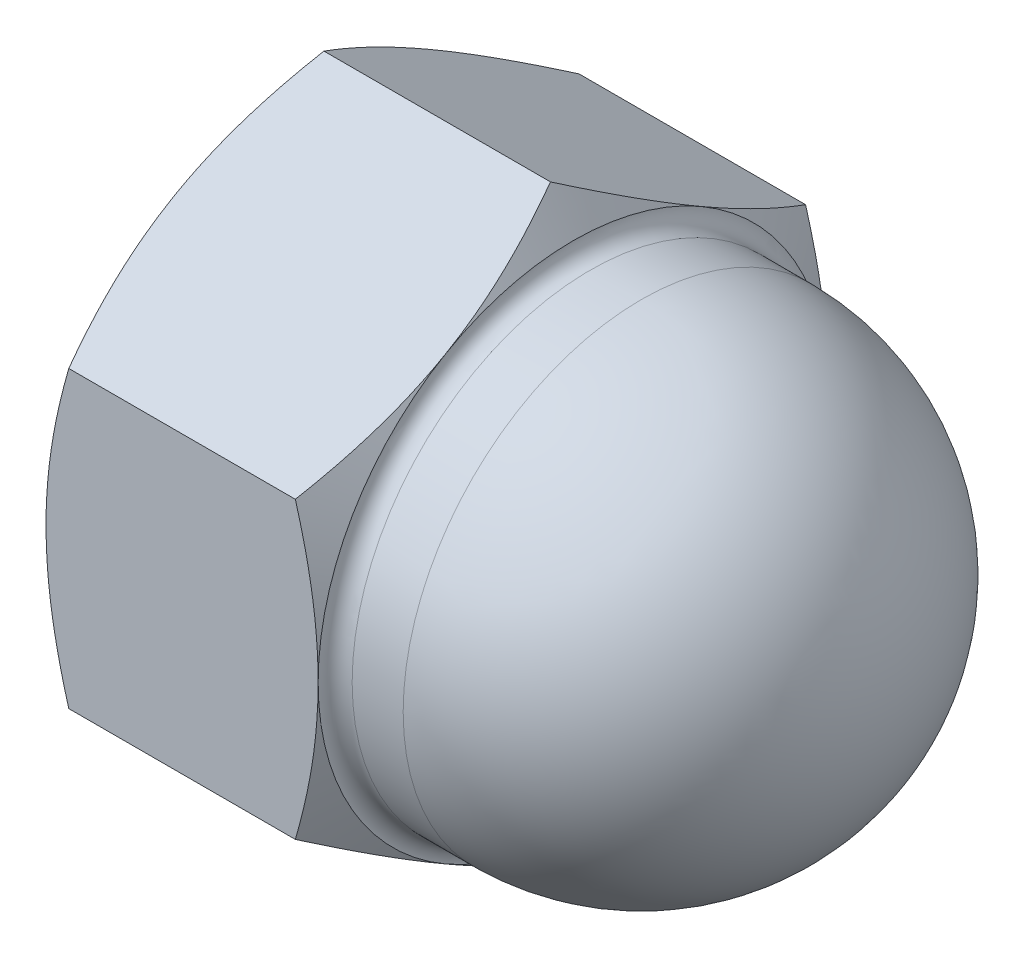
ISO-10303-21;
HEADER;
FILE_DESCRIPTION(('STEP AP214'),'2;1');
FILE_NAME('part.step','',(''),(''),'','','');
FILE_SCHEMA(('AUTOMOTIVE_DESIGN { 1 0 10303 214 1 1 1 1 }'));
ENDSEC;
DATA;
#1=APPLICATION_CONTEXT('core data for automotive mechanical design processes');
#2=APPLICATION_PROTOCOL_DEFINITION('international standard','automotive_design',2000,#1);
#3=PRODUCT_CONTEXT('',#1,'mechanical');
#4=PRODUCT('Part','Part','',(#3));
#5=PRODUCT_RELATED_PRODUCT_CATEGORY('part','',(#4));
#6=PRODUCT_DEFINITION_FORMATION('','',#4);
#7=PRODUCT_DEFINITION_CONTEXT('part definition',#1,'design');
#8=PRODUCT_DEFINITION('design','',#6,#7);
#9=PRODUCT_DEFINITION_SHAPE('','',#8);
#10=(LENGTH_UNIT() NAMED_UNIT(*) SI_UNIT(.MILLI.,.METRE.));
#11=(NAMED_UNIT(*) PLANE_ANGLE_UNIT() SI_UNIT($,.RADIAN.));
#12=(NAMED_UNIT(*) SI_UNIT($,.STERADIAN.) SOLID_ANGLE_UNIT());
#13=UNCERTAINTY_MEASURE_WITH_UNIT(LENGTH_MEASURE(1.E-05),#10,'distance_accuracy_value','');
#14=(GEOMETRIC_REPRESENTATION_CONTEXT(3) GLOBAL_UNCERTAINTY_ASSIGNED_CONTEXT((#13)) GLOBAL_UNIT_ASSIGNED_CONTEXT((#10,
#11,#12)) REPRESENTATION_CONTEXT('',''));
#15=CARTESIAN_POINT('',(0.,0.,0.));
#16=DIRECTION('',(0.,0.,1.));
#17=DIRECTION('',(1.,0.,0.));
#18=AXIS2_PLACEMENT_3D('',#15,#16,#17);
#19=CARTESIAN_POINT('',(0.,0.,0.));
#20=DIRECTION('',(-1.,0.,0.));
#21=DIRECTION('',(0.,0.,1.));
#22=AXIS2_PLACEMENT_3D('',#19,#20,#21);
#23=CYLINDRICAL_SURFACE('',#22,14.);
#24=CARTESIAN_POINT('',(17.,0.,0.));
#25=DIRECTION('',(-1.,0.,0.));
#26=DIRECTION('',(0.,0.,1.));
#27=AXIS2_PLACEMENT_3D('',#24,#25,#26);
#28=CIRCLE('',#27,14.);
#29=CARTESIAN_POINT('',(17.,0.,14.));
#30=VERTEX_POINT('',#29);
#31=EDGE_CURVE('E11',#30,#30,#28,.F.);
#32=ORIENTED_EDGE('',*,*,#31,.T.);
#33=EDGE_LOOP('',(#32));
#34=FACE_BOUND('',#33,.T.);
#35=CARTESIAN_POINT('',(20.,0.,0.));
#36=DIRECTION('',(-1.,0.,0.));
#37=DIRECTION('',(0.,0.,1.));
#38=AXIS2_PLACEMENT_3D('',#35,#36,#37);
#39=CIRCLE('',#38,14.);
#40=CARTESIAN_POINT('',(20.,0.,14.));
#41=VERTEX_POINT('',#40);
#42=EDGE_CURVE('E271',#41,#41,#39,.T.);
#43=ORIENTED_EDGE('',*,*,#42,.T.);
#44=EDGE_LOOP('',(#43));
#45=FACE_BOUND('',#44,.T.);
#46=ADVANCED_FACE('F41',(#34,#45),#23,.T.);
#47=CARTESIAN_POINT('',(20.,0.,0.));
#48=DIRECTION('',(-1.,0.,0.));
#49=DIRECTION('',(0.,1.,0.));
#50=AXIS2_PLACEMENT_3D('',#47,#48,#49);
#51=SPHERICAL_SURFACE('',#50,14.);
#52=ORIENTED_EDGE('',*,*,#42,.F.);
#53=EDGE_LOOP('',(#52));
#54=FACE_BOUND('',#53,.T.);
#55=ADVANCED_FACE('F391',(#54),#51,.T.);
#56=CARTESIAN_POINT('',(13.2168783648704,0.,0.));
#57=DIRECTION('',(-1.,0.,0.));
#58=DIRECTION('',(0.,0.,1.));
#59=AXIS2_PLACEMENT_3D('',#56,#57,#58);
#60=CONICAL_SURFACE('',#59,19.8205080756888,1.0471975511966);
#61=CARTESIAN_POINT('',(8.72490551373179,-23.1690741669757,15.));
#62=CARTESIAN_POINT('',(8.88346375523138,-22.8419055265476,15.));
#63=CARTESIAN_POINT('',(9.04122421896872,-22.5143504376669,15.));
#64=CARTESIAN_POINT('',(9.35496872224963,-21.8583866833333,15.));
#65=CARTESIAN_POINT('',(9.5109527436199,-21.5299780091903,15.));
#66=CARTESIAN_POINT('',(9.97601055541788,-20.5432618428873,15.));
#67=CARTESIAN_POINT('',(10.2821423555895,-19.8835624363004,15.));
#68=CARTESIAN_POINT('',(10.8863599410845,-18.5560823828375,15.));
#69=CARTESIAN_POINT('',(11.1843920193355,-17.8882772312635,15.));
#70=CARTESIAN_POINT('',(11.7681393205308,-16.5473234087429,15.));
#71=CARTESIAN_POINT('',(12.0538551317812,-15.8741749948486,15.));
#72=CARTESIAN_POINT('',(12.6184951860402,-14.5000785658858,15.));
#73=CARTESIAN_POINT('',(12.8969197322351,-13.7989241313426,15.));
#74=CARTESIAN_POINT('',(13.4324703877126,-12.3883726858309,15.));
#75=CARTESIAN_POINT('',(13.6895940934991,-11.6789747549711,15.));
#76=CARTESIAN_POINT('',(14.1757206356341,-10.2521895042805,15.));
#77=CARTESIAN_POINT('',(14.4047812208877,-9.53482202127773,15.));
#78=CARTESIAN_POINT('',(14.8273819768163,-8.08972904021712,15.));
#79=CARTESIAN_POINT('',(15.0209334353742,-7.36200691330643,15.));
#80=CARTESIAN_POINT('',(15.2770501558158,-6.26455118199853,15.));
#81=CARTESIAN_POINT('',(15.3565523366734,-5.89874555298,15.));
#82=CARTESIAN_POINT('',(15.5031975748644,-5.16465247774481,15.));
#83=CARTESIAN_POINT('',(15.5703408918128,-4.79636508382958,15.));
#84=CARTESIAN_POINT('',(15.691077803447,-4.05756782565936,15.));
#85=CARTESIAN_POINT('',(15.7446715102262,-3.68705797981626,15.));
#86=CARTESIAN_POINT('',(15.8372361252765,-2.94421917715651,15.));
#87=CARTESIAN_POINT('',(15.8762076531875,-2.57189029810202,15.));
#88=CARTESIAN_POINT('',(15.9382707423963,-1.83075081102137,15.));
#89=CARTESIAN_POINT('',(15.961561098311,-1.46195695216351,15.));
#90=CARTESIAN_POINT('',(15.992531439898,-0.723715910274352,15.));
#91=CARTESIAN_POINT('',(16.000211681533,-0.35426873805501,15.));
#92=CARTESIAN_POINT('',(15.999779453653,0.384620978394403,15.));
#93=CARTESIAN_POINT('',(15.9916668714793,0.754063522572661,15.));
#94=CARTESIAN_POINT('',(15.9598452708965,1.49227999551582,15.));
#95=CARTESIAN_POINT('',(15.9361355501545,1.86105389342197,15.));
#96=CARTESIAN_POINT('',(15.8606650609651,2.75020108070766,15.));
#97=CARTESIAN_POINT('',(15.8013447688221,3.26994378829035,15.));
#98=CARTESIAN_POINT('',(15.6549761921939,4.30551289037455,15.));
#99=CARTESIAN_POINT('',(15.5679240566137,4.82133873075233,15.));
#100=CARTESIAN_POINT('',(15.3691887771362,5.84860326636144,15.));
#101=CARTESIAN_POINT('',(15.2574861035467,6.36003814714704,15.));
#102=CARTESIAN_POINT('',(15.0128532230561,7.37774872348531,15.));
#103=CARTESIAN_POINT('',(14.8799233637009,7.88402450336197,15.));
#104=CARTESIAN_POINT('',(14.5929500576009,8.90245513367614,15.));
#105=CARTESIAN_POINT('',(14.4385092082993,9.41449722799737,15.));
#106=CARTESIAN_POINT('',(14.113878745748,10.4335364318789,15.));
#107=CARTESIAN_POINT('',(13.9436890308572,10.9405335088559,15.));
#108=CARTESIAN_POINT('',(13.5902447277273,11.9497365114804,15.));
#109=CARTESIAN_POINT('',(13.406994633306,12.4519440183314,15.));
#110=CARTESIAN_POINT('',(13.0295649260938,13.4522120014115,15.));
#111=CARTESIAN_POINT('',(12.8353854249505,13.9502725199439,15.));
#112=CARTESIAN_POINT('',(12.3752305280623,15.0992288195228,15.));
#113=CARTESIAN_POINT('',(12.105925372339,15.7487887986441,15.));
#114=CARTESIAN_POINT('',(11.5547925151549,17.0425896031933,15.));
#115=CARTESIAN_POINT('',(11.2729641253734,17.6868301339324,15.));
#116=CARTESIAN_POINT('',(10.6992189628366,18.9709471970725,15.));
#117=CARTESIAN_POINT('',(10.4073001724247,19.6108228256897,15.));
#118=CARTESIAN_POINT('',(9.81534813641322,20.8867861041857,15.));
#119=CARTESIAN_POINT('',(9.51531504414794,21.522873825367,15.));
#120=CARTESIAN_POINT('',(8.90830232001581,22.7925136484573,15.));
#121=CARTESIAN_POINT('',(8.60131594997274,23.4260625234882,15.));
#122=CARTESIAN_POINT('',(7.98185068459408,24.6904686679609,15.));
#123=CARTESIAN_POINT('',(7.66937176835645,25.3213259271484,15.));
#124=CARTESIAN_POINT('',(7.03987592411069,26.580678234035,15.));
#125=CARTESIAN_POINT('',(6.72285952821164,27.2091735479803,15.));
#126=CARTESIAN_POINT('',(6.08497726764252,28.4642087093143,15.));
#127=CARTESIAN_POINT('',(5.76411138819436,29.0907485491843,15.));
#128=CARTESIAN_POINT('',(4.84852370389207,30.8671956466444,15.));
#129=CARTESIAN_POINT('',(4.24993335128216,32.0151090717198,15.));
#130=CARTESIAN_POINT('',(3.04449894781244,34.3066304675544,15.));
#131=CARTESIAN_POINT('',(2.43765463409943,35.4502382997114,15.));
#132=CARTESIAN_POINT('',(1.2190415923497,37.73139285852,15.));
#133=CARTESIAN_POINT('',(0.60728767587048,38.868947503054,15.));
#134=CARTESIAN_POINT('',(-0.314051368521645,40.5732346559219,15.));
#135=CARTESIAN_POINT('',(-0.621774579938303,41.1409752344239,15.));
#136=CARTESIAN_POINT('',(-1.23833467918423,42.275850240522,15.));
#137=CARTESIAN_POINT('',(-1.54717156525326,42.8429846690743,15.));
#138=CARTESIAN_POINT('',(-1.85650205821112,43.4098498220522,15.));
#139=B_SPLINE_CURVE_WITH_KNOTS('',3,(#61,#62,#63,#64,#65,#66,#67,#68,#69,#70,#71,#72,#73,#74,
#75,#76,#77,#78,#79,#80,#81,#82,#83,#84,#85,#86,#87,#88,#89,#90,#91,#92,#93,#94,#95,#96,#97,#98,
#99,#100,#101,#102,#103,#104,#105,#106,#107,#108,#109,#110,#111,#112,#113,#114,#115,#116,#117,
#118,#119,#120,#121,#122,#123,#124,#125,#126,#127,#128,#129,#130,#131,#132,#133,#134,#135,#136,
#137,#138),.UNSPECIFIED.,.F.,.F.,(4,2,2,2,2,2,2,2,2,2,2,2,2,2,2,2,2,2,2,2,2,2,2,2,2,2,2,2,2,2,2,
2,2,2,2,2,2,2,4),(0.,1.09069516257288,2.18140147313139,4.36314172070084,6.55691851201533,
8.75059039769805,11.0135627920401,13.2767901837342,15.5352791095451,17.7930488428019,
18.9159095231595,20.0387466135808,21.1615744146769,22.2843546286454,23.3926186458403,
24.5008644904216,25.6091182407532,26.7174218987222,28.2859027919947,29.8546015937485,
31.4245477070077,32.9944681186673,34.5986435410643,36.2028293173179,37.8064657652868,
39.4100858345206,41.5194319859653,43.6288942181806,45.7387807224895,47.8486273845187,
49.9606143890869,52.0726094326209,54.1843587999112,56.2961162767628,60.1798964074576,
64.063800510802,67.9386334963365,69.8759519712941,71.8132673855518),.UNSPECIFIED.);
#140=CARTESIAN_POINT('',(16.,0.,15.));
#141=VERTEX_POINT('',#140);
#142=CARTESIAN_POINT('',(14.6602540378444,-8.66025403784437,15.));
#143=VERTEX_POINT('',#142);
#144=EDGE_CURVE('E264',#141,#143,#139,.F.);
#145=ORIENTED_EDGE('',*,*,#144,.T.);
#146=CARTESIAN_POINT('',(14.6601873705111,-8.66013856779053,15.0002));
#147=CARTESIAN_POINT('',(14.7700782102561,-8.85048754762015,14.6705058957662));
#148=CARTESIAN_POINT('',(14.8749824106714,-9.04157899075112,14.3395258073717));
#149=CARTESIAN_POINT('',(15.0734314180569,-9.42529420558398,13.674911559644));
#150=CARTESIAN_POINT('',(15.1669724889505,-9.617918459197,13.3412765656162));
#151=CARTESIAN_POINT('',(15.3414378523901,-10.0050715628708,12.6707077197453));
#152=CARTESIAN_POINT('',(15.4223322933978,-10.199603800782,12.333767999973));
#153=CARTESIAN_POINT('',(15.569767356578,-10.5900200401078,11.6575472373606));
#154=CARTESIAN_POINT('',(15.6363087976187,-10.7859039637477,11.3182663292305));
#155=CARTESIAN_POINT('',(15.7522076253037,-11.1740042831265,10.6460568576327));
#156=CARTESIAN_POINT('',(15.8019486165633,-11.3661918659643,10.3131781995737));
#157=CARTESIAN_POINT('',(15.8853532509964,-11.7514476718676,9.64589556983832));
#158=CARTESIAN_POINT('',(15.9190165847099,-11.9445159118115,9.31149156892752));
#159=CARTESIAN_POINT('',(15.9694159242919,-12.3309767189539,8.64212181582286));
#160=CARTESIAN_POINT('',(15.9861720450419,-12.5243686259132,8.30715720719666));
#161=CARTESIAN_POINT('',(16.002396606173,-12.9113309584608,7.63691878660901));
#162=CARTESIAN_POINT('',(16.0018655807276,-13.1049013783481,7.30164498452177));
#163=CARTESIAN_POINT('',(15.9847233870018,-13.4667798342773,6.67485311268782));
#164=CARTESIAN_POINT('',(15.970203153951,-13.6351136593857,6.38329037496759));
#165=CARTESIAN_POINT('',(15.9283628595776,-13.9713941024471,5.80083556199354));
#166=CARTESIAN_POINT('',(15.9010418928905,-14.1393406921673,5.50994353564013));
#167=CARTESIAN_POINT('',(15.8340764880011,-14.4747554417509,4.92898814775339));
#168=CARTESIAN_POINT('',(15.7944218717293,-14.6422230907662,4.63892567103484));
#169=CARTESIAN_POINT('',(15.7034848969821,-14.9763732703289,4.06016058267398));
#170=CARTESIAN_POINT('',(15.6522017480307,-15.1430557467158,3.77145806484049));
#171=CARTESIAN_POINT('',(15.4796131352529,-15.6490296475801,2.89508556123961));
#172=CARTESIAN_POINT('',(15.3410988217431,-15.9868558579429,2.30995340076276));
#173=CARTESIAN_POINT('',(15.0267280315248,-16.6574708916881,1.14841408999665));
#174=CARTESIAN_POINT('',(14.8509453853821,-16.9902683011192,0.571992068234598));
#175=CARTESIAN_POINT('',(14.6601873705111,-17.3206235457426,-0.000199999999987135));
#176=B_SPLINE_CURVE_WITH_KNOTS('',3,(#146,#147,#148,#149,#150,#151,#152,#153,#154,#155,#156,
#157,#158,#159,#160,#161,#162,#163,#164,#165,#166,#167,#168,#169,#170,#171,#172,#173,#174,#175),
.UNSPECIFIED.,.F.,.F.,(4,2,2,2,2,2,2,2,2,2,2,2,2,2,4),(0.,1.18875411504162,2.37789802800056,
3.56980778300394,4.76164951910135,5.92407379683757,7.0865204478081,8.24758247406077,
9.40860862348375,10.4193068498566,11.4300765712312,12.4416826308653,13.4533574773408,
15.5211962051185,17.5849760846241),.UNSPECIFIED.);
#177=CARTESIAN_POINT('',(16.,-12.9903810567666,7.50000000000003));
#178=VERTEX_POINT('',#177);
#179=EDGE_CURVE('E258',#143,#178,#176,.T.);
#180=ORIENTED_EDGE('',*,*,#179,.T.);
#181=CARTESIAN_POINT('',(16.,0.,0.));
#182=DIRECTION('',(-1.,0.,0.));
#183=DIRECTION('',(0.,0.,1.));
#184=AXIS2_PLACEMENT_3D('',#181,#182,#183);
#185=CIRCLE('',#184,15.);
#186=EDGE_CURVE('E151',#178,#141,#185,.T.);
#187=ORIENTED_EDGE('',*,*,#186,.T.);
#188=EDGE_LOOP('',(#145,#180,#187));
#189=FACE_BOUND('',#188,.T.);
#190=ADVANCED_FACE('F360',(#189),#60,.T.);
#191=CARTESIAN_POINT('',(14.6602540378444,-17.3205080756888,0.));
#192=VERTEX_POINT('',#191);
#193=EDGE_CURVE('E248',#178,#192,#176,.T.);
#194=ORIENTED_EDGE('',*,*,#193,.T.);
#195=CARTESIAN_POINT('',(14.6601873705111,-17.3206235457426,0.000200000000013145));
#196=CARTESIAN_POINT('',(14.7700782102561,-17.130274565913,-0.329494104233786));
#197=CARTESIAN_POINT('',(14.8749824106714,-16.939183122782,-0.660474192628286));
#198=CARTESIAN_POINT('',(15.0734314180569,-16.5554679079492,-1.325088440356));
#199=CARTESIAN_POINT('',(15.1669724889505,-16.3628436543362,-1.65872343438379));
#200=CARTESIAN_POINT('',(15.3414378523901,-15.9756905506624,-2.32929228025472));
#201=CARTESIAN_POINT('',(15.4223322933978,-15.7811583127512,-2.666232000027));
#202=CARTESIAN_POINT('',(15.5697673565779,-15.3907420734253,-3.34245276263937));
#203=CARTESIAN_POINT('',(15.6363087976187,-15.1948581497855,-3.6817336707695));
#204=CARTESIAN_POINT('',(15.7522076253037,-14.8067578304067,-4.35394314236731));
#205=CARTESIAN_POINT('',(15.8019486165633,-14.6145702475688,-4.68682180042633));
#206=CARTESIAN_POINT('',(15.8853532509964,-14.2293144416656,-5.35410443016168));
#207=CARTESIAN_POINT('',(15.9190165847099,-14.0362462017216,-5.68850843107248));
#208=CARTESIAN_POINT('',(15.9694159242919,-13.6497853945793,-6.35787818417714));
#209=CARTESIAN_POINT('',(15.9861720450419,-13.4563934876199,-6.69284279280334));
#210=CARTESIAN_POINT('',(16.002396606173,-13.0694311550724,-7.363081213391));
#211=CARTESIAN_POINT('',(16.0018655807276,-12.8758607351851,-7.69835501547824));
#212=CARTESIAN_POINT('',(15.9847233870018,-12.5139822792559,-8.32514688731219));
#213=CARTESIAN_POINT('',(15.970203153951,-12.3456484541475,-8.61670962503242));
#214=CARTESIAN_POINT('',(15.9283628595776,-12.0093680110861,-9.19916443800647));
#215=CARTESIAN_POINT('',(15.9010418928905,-11.8414214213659,-9.49005646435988));
#216=CARTESIAN_POINT('',(15.8340764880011,-11.5060066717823,-10.0710118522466));
#217=CARTESIAN_POINT('',(15.7944218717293,-11.338539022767,-10.3610743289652));
#218=CARTESIAN_POINT('',(15.7034848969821,-11.0043888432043,-10.939839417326));
#219=CARTESIAN_POINT('',(15.6522017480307,-10.8377063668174,-11.2285419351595));
#220=CARTESIAN_POINT('',(15.4796131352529,-10.3317324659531,-12.1049144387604));
#221=CARTESIAN_POINT('',(15.3410988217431,-9.99390625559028,-12.6900465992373));
#222=CARTESIAN_POINT('',(15.0267280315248,-9.32329122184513,-13.8515859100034));
#223=CARTESIAN_POINT('',(14.8509453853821,-8.99049381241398,-14.4280079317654));
#224=CARTESIAN_POINT('',(14.6601873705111,-8.66013856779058,-15.0002));
#225=B_SPLINE_CURVE_WITH_KNOTS('',3,(#195,#196,#197,#198,#199,#200,#201,#202,#203,#204,#205,
#206,#207,#208,#209,#210,#211,#212,#213,#214,#215,#216,#217,#218,#219,#220,#221,#222,#223,#224),
.UNSPECIFIED.,.F.,.F.,(4,2,2,2,2,2,2,2,2,2,2,2,2,2,4),(0.,1.18875411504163,2.37789802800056,
3.56980778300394,4.76164951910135,5.92407379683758,7.08652044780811,8.24758247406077,
9.40860862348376,10.4193068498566,11.4300765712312,12.4416826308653,13.4533574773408,
15.5211962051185,17.5849760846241),.UNSPECIFIED.);
#226=CARTESIAN_POINT('',(16.,-12.9903810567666,-7.49999999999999));
#227=VERTEX_POINT('',#226);
#228=EDGE_CURVE('E257',#192,#227,#225,.T.);
#229=ORIENTED_EDGE('',*,*,#228,.T.);
#230=EDGE_CURVE('E307',#227,#178,#185,.T.);
#231=ORIENTED_EDGE('',*,*,#230,.T.);
#232=EDGE_LOOP('',(#194,#229,#231));
#233=FACE_BOUND('',#232,.T.);
#234=ADVANCED_FACE('F352',(#233),#60,.T.);
#235=CARTESIAN_POINT('',(14.6602540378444,-8.66025403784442,-15.));
#236=VERTEX_POINT('',#235);
#237=EDGE_CURVE('E256',#227,#236,#225,.T.);
#238=ORIENTED_EDGE('',*,*,#237,.T.);
#239=CARTESIAN_POINT('',(8.72490551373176,-23.1690741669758,-15.));
#240=CARTESIAN_POINT('',(8.88346375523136,-22.8419055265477,-15.));
#241=CARTESIAN_POINT('',(9.0412242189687,-22.5143504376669,-15.));
#242=CARTESIAN_POINT('',(9.3549687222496,-21.8583866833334,-15.));
#243=CARTESIAN_POINT('',(9.51095274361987,-21.5299780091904,-15.));
#244=CARTESIAN_POINT('',(9.97601055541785,-20.5432618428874,-15.));
#245=CARTESIAN_POINT('',(10.2821423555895,-19.8835624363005,-15.));
#246=CARTESIAN_POINT('',(10.8863599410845,-18.5560823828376,-15.));
#247=CARTESIAN_POINT('',(11.1843920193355,-17.8882772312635,-15.));
#248=CARTESIAN_POINT('',(11.7681393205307,-16.5473234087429,-15.));
#249=CARTESIAN_POINT('',(12.0538551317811,-15.8741749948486,-15.));
#250=CARTESIAN_POINT('',(12.6184951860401,-14.5000785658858,-15.));
#251=CARTESIAN_POINT('',(12.8969197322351,-13.7989241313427,-15.));
#252=CARTESIAN_POINT('',(13.4324703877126,-12.3883726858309,-15.));
#253=CARTESIAN_POINT('',(13.6895940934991,-11.6789747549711,-15.));
#254=CARTESIAN_POINT('',(14.1757206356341,-10.2521895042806,-15.));
#255=CARTESIAN_POINT('',(14.4047812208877,-9.53482202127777,-15.));
#256=CARTESIAN_POINT('',(14.8273819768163,-8.08972904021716,-15.));
#257=CARTESIAN_POINT('',(15.0209334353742,-7.36200691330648,-15.));
#258=CARTESIAN_POINT('',(15.2770501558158,-6.26455118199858,-15.));
#259=CARTESIAN_POINT('',(15.3565523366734,-5.89874555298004,-15.));
#260=CARTESIAN_POINT('',(15.5031975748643,-5.16465247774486,-15.));
#261=CARTESIAN_POINT('',(15.5703408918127,-4.79636508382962,-15.));
#262=CARTESIAN_POINT('',(15.691077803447,-4.0575678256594,-15.));
#263=CARTESIAN_POINT('',(15.7446715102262,-3.6870579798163,-15.));
#264=CARTESIAN_POINT('',(15.8372361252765,-2.94421917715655,-15.));
#265=CARTESIAN_POINT('',(15.8762076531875,-2.57189029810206,-15.));
#266=CARTESIAN_POINT('',(15.9382707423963,-1.83075081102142,-15.));
#267=CARTESIAN_POINT('',(15.961561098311,-1.46195695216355,-15.));
#268=CARTESIAN_POINT('',(15.992531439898,-0.723715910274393,-15.));
#269=CARTESIAN_POINT('',(16.000211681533,-0.354268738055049,-15.));
#270=CARTESIAN_POINT('',(15.999779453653,0.384620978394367,-15.));
#271=CARTESIAN_POINT('',(15.9916668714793,0.754063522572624,-15.));
#272=CARTESIAN_POINT('',(15.9598452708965,1.49227999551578,-15.));
#273=CARTESIAN_POINT('',(15.9361355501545,1.86105389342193,-15.));
#274=CARTESIAN_POINT('',(15.8606650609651,2.75020108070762,-15.));
#275=CARTESIAN_POINT('',(15.8013447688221,3.2699437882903,-15.));
#276=CARTESIAN_POINT('',(15.6549761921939,4.30551289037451,-15.));
#277=CARTESIAN_POINT('',(15.5679240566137,4.82133873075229,-15.));
#278=CARTESIAN_POINT('',(15.3691887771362,5.84860326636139,-15.));
#279=CARTESIAN_POINT('',(15.2574861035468,6.36003814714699,-15.));
#280=CARTESIAN_POINT('',(15.0128532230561,7.37774872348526,-15.));
#281=CARTESIAN_POINT('',(14.879923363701,7.88402450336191,-15.));
#282=CARTESIAN_POINT('',(14.5929500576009,8.90245513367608,-15.));
#283=CARTESIAN_POINT('',(14.4385092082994,9.41449722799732,-15.));
#284=CARTESIAN_POINT('',(14.1138787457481,10.4335364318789,-15.));
#285=CARTESIAN_POINT('',(13.9436890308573,10.9405335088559,-15.));
#286=CARTESIAN_POINT('',(13.5902447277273,11.9497365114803,-15.));
#287=CARTESIAN_POINT('',(13.406994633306,12.4519440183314,-15.));
#288=CARTESIAN_POINT('',(13.0295649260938,13.4522120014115,-15.));
#289=CARTESIAN_POINT('',(12.8353854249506,13.9502725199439,-15.));
#290=CARTESIAN_POINT('',(12.3752305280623,15.0992288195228,-15.));
#291=CARTESIAN_POINT('',(12.105925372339,15.748788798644,-15.));
#292=CARTESIAN_POINT('',(11.5547925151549,17.0425896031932,-15.));
#293=CARTESIAN_POINT('',(11.2729641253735,17.6868301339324,-15.));
#294=CARTESIAN_POINT('',(10.6992189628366,18.9709471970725,-15.));
#295=CARTESIAN_POINT('',(10.4073001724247,19.6108228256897,-15.));
#296=CARTESIAN_POINT('',(9.81534813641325,20.8867861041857,-15.));
#297=CARTESIAN_POINT('',(9.51531504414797,21.522873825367,-15.));
#298=CARTESIAN_POINT('',(8.90830232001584,22.7925136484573,-15.));
#299=CARTESIAN_POINT('',(8.60131594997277,23.4260625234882,-15.));
#300=CARTESIAN_POINT('',(7.98185068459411,24.6904686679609,-15.));
#301=CARTESIAN_POINT('',(7.66937176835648,25.3213259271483,-15.));
#302=CARTESIAN_POINT('',(7.03987592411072,26.5806782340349,-15.));
#303=CARTESIAN_POINT('',(6.72285952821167,27.2091735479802,-15.));
#304=CARTESIAN_POINT('',(6.08497726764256,28.4642087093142,-15.));
#305=CARTESIAN_POINT('',(5.76411138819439,29.0907485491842,-15.));
#306=CARTESIAN_POINT('',(4.84852370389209,30.8671956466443,-15.));
#307=CARTESIAN_POINT('',(4.24993335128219,32.0151090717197,-15.));
#308=CARTESIAN_POINT('',(3.04449894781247,34.3066304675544,-15.));
#309=CARTESIAN_POINT('',(2.43765463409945,35.4502382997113,-15.));
#310=CARTESIAN_POINT('',(1.21904159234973,37.73139285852,-15.));
#311=CARTESIAN_POINT('',(0.607287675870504,38.8689475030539,-15.));
#312=CARTESIAN_POINT('',(-0.314051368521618,40.5732346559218,-15.));
#313=CARTESIAN_POINT('',(-0.621774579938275,41.1409752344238,-15.));
#314=CARTESIAN_POINT('',(-1.2383346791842,42.2758502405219,-15.));
#315=CARTESIAN_POINT('',(-1.54717156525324,42.8429846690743,-15.));
#316=CARTESIAN_POINT('',(-1.85650205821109,43.4098498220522,-15.));
#317=B_SPLINE_CURVE_WITH_KNOTS('',3,(#239,#240,#241,#242,#243,#244,#245,#246,#247,#248,#249,
#250,#251,#252,#253,#254,#255,#256,#257,#258,#259,#260,#261,#262,#263,#264,#265,#266,#267,#268,
#269,#270,#271,#272,#273,#274,#275,#276,#277,#278,#279,#280,#281,#282,#283,#284,#285,#286,#287,
#288,#289,#290,#291,#292,#293,#294,#295,#296,#297,#298,#299,#300,#301,#302,#303,#304,#305,#306,
#307,#308,#309,#310,#311,#312,#313,#314,#315,#316),.UNSPECIFIED.,.F.,.F.,(4,2,2,2,2,2,2,2,2,2,2,
2,2,2,2,2,2,2,2,2,2,2,2,2,2,2,2,2,2,2,2,2,2,2,2,2,2,2,4),(0.,1.09069516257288,2.18140147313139,
4.36314172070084,6.55691851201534,8.75059039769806,11.0135627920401,13.2767901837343,
15.5352791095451,17.7930488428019,18.9159095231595,20.0387466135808,21.1615744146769,
22.2843546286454,23.3926186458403,24.5008644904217,25.6091182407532,26.7174218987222,
28.2859027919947,29.8546015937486,31.4245477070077,32.9944681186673,34.5986435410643,
36.2028293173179,37.8064657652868,39.4100858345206,41.5194319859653,43.6288942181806,
45.7387807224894,47.8486273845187,49.9606143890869,52.0726094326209,54.1843587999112,
56.2961162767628,60.1798964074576,64.0638005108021,67.9386334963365,69.8759519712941,
71.8132673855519),.UNSPECIFIED.);
#318=CARTESIAN_POINT('',(16.,0.,-15.));
#319=VERTEX_POINT('',#318);
#320=EDGE_CURVE('E64',#319,#236,#317,.F.);
#321=ORIENTED_EDGE('',*,*,#320,.F.);
#322=EDGE_CURVE('E346',#319,#227,#185,.T.);
#323=ORIENTED_EDGE('',*,*,#322,.T.);
#324=EDGE_LOOP('',(#238,#321,#323));
#325=FACE_BOUND('',#324,.T.);
#326=ADVANCED_FACE('F581',(#325),#60,.T.);
#327=CARTESIAN_POINT('',(14.6601873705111,8.66013856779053,-15.0002));
#328=CARTESIAN_POINT('',(14.7700782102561,8.85048754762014,-14.6705058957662));
#329=CARTESIAN_POINT('',(14.8749824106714,9.04157899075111,-14.3395258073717));
#330=CARTESIAN_POINT('',(15.0734314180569,9.42529420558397,-13.674911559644));
#331=CARTESIAN_POINT('',(15.1669724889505,9.61791845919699,-13.3412765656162));
#332=CARTESIAN_POINT('',(15.3414378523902,10.0050715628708,-12.6707077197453));
#333=CARTESIAN_POINT('',(15.4223322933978,10.199603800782,-12.333767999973));
#334=CARTESIAN_POINT('',(15.569767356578,10.5900200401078,-11.6575472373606));
#335=CARTESIAN_POINT('',(15.6363087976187,10.7859039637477,-11.3182663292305));
#336=CARTESIAN_POINT('',(15.7522076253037,11.1740042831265,-10.6460568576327));
#337=CARTESIAN_POINT('',(15.8019486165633,11.3661918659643,-10.3131781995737));
#338=CARTESIAN_POINT('',(15.8853532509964,11.7514476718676,-9.64589556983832));
#339=CARTESIAN_POINT('',(15.9190165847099,11.9445159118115,-9.31149156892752));
#340=CARTESIAN_POINT('',(15.9694159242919,12.3309767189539,-8.64212181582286));
#341=CARTESIAN_POINT('',(15.9861720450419,12.5243686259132,-8.30715720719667));
#342=CARTESIAN_POINT('',(16.002396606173,12.9113309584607,-7.63691878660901));
#343=CARTESIAN_POINT('',(16.0018655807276,13.104901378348,-7.30164498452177));
#344=CARTESIAN_POINT('',(15.9847233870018,13.4667798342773,-6.67485311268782));
#345=CARTESIAN_POINT('',(15.970203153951,13.6351136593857,-6.38329037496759));
#346=CARTESIAN_POINT('',(15.9283628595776,13.9713941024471,-5.80083556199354));
#347=CARTESIAN_POINT('',(15.9010418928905,14.1393406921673,-5.50994353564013));
#348=CARTESIAN_POINT('',(15.8340764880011,14.4747554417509,-4.92898814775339));
#349=CARTESIAN_POINT('',(15.7944218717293,14.6422230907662,-4.63892567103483));
#350=CARTESIAN_POINT('',(15.7034848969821,14.9763732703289,-4.06016058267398));
#351=CARTESIAN_POINT('',(15.6522017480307,15.1430557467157,-3.77145806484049));
#352=CARTESIAN_POINT('',(15.4796131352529,15.6490296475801,-2.89508556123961));
#353=CARTESIAN_POINT('',(15.3410988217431,15.9868558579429,-2.30995340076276));
#354=CARTESIAN_POINT('',(15.0267280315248,16.6574708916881,-1.14841408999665));
#355=CARTESIAN_POINT('',(14.8509453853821,16.9902683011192,-0.571992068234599));
#356=CARTESIAN_POINT('',(14.6601873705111,17.3206235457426,0.000199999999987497));
#357=B_SPLINE_CURVE_WITH_KNOTS('',3,(#327,#328,#329,#330,#331,#332,#333,#334,#335,#336,#337,
#338,#339,#340,#341,#342,#343,#344,#345,#346,#347,#348,#349,#350,#351,#352,#353,#354,#355,#356),
.UNSPECIFIED.,.F.,.F.,(4,2,2,2,2,2,2,2,2,2,2,2,2,2,4),(0.,1.18875411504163,2.37789802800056,
3.56980778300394,4.76164951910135,5.92407379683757,7.0865204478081,8.24758247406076,
9.40860862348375,10.4193068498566,11.4300765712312,12.4416826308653,13.4533574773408,
15.5211962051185,17.5849760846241),.UNSPECIFIED.);
#358=CARTESIAN_POINT('',(14.6602540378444,8.66025403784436,-15.));
#359=VERTEX_POINT('',#358);
#360=CARTESIAN_POINT('',(16.,12.9903810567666,-7.50000000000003));
#361=VERTEX_POINT('',#360);
#362=EDGE_CURVE('E340',#359,#361,#357,.T.);
#363=ORIENTED_EDGE('',*,*,#362,.T.);
#364=EDGE_CURVE('E348',#361,#319,#185,.T.);
#365=ORIENTED_EDGE('',*,*,#364,.T.);
#366=EDGE_CURVE('E337',#359,#319,#317,.F.);
#367=ORIENTED_EDGE('',*,*,#366,.F.);
#368=EDGE_LOOP('',(#363,#365,#367));
#369=FACE_BOUND('',#368,.T.);
#370=ADVANCED_FACE('F205',(#369),#60,.T.);
#371=CARTESIAN_POINT('',(14.6601873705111,17.3206235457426,-0.000200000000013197));
#372=CARTESIAN_POINT('',(14.7700782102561,17.130274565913,0.329494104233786));
#373=CARTESIAN_POINT('',(14.8749824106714,16.939183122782,0.660474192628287));
#374=CARTESIAN_POINT('',(15.0734314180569,16.5554679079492,1.32508844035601));
#375=CARTESIAN_POINT('',(15.1669724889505,16.3628436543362,1.65872343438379));
#376=CARTESIAN_POINT('',(15.3414378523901,15.9756905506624,2.32929228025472));
#377=CARTESIAN_POINT('',(15.4223322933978,15.7811583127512,2.666232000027));
#378=CARTESIAN_POINT('',(15.5697673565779,15.3907420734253,3.34245276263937));
#379=CARTESIAN_POINT('',(15.6363087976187,15.1948581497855,3.6817336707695));
#380=CARTESIAN_POINT('',(15.7522076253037,14.8067578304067,4.3539431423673));
#381=CARTESIAN_POINT('',(15.8019486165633,14.6145702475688,4.68682180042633));
#382=CARTESIAN_POINT('',(15.8853532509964,14.2293144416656,5.35410443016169));
#383=CARTESIAN_POINT('',(15.9190165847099,14.0362462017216,5.68850843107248));
#384=CARTESIAN_POINT('',(15.9694159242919,13.6497853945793,6.35787818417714));
#385=CARTESIAN_POINT('',(15.9861720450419,13.4563934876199,6.69284279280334));
#386=CARTESIAN_POINT('',(16.002396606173,13.0694311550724,7.363081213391));
#387=CARTESIAN_POINT('',(16.0018655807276,12.8758607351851,7.69835501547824));
#388=CARTESIAN_POINT('',(15.9847233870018,12.5139822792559,8.32514688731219));
#389=CARTESIAN_POINT('',(15.970203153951,12.3456484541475,8.61670962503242));
#390=CARTESIAN_POINT('',(15.9283628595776,12.0093680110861,9.19916443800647));
#391=CARTESIAN_POINT('',(15.9010418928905,11.8414214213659,9.49005646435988));
#392=CARTESIAN_POINT('',(15.8340764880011,11.5060066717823,10.0710118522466));
#393=CARTESIAN_POINT('',(15.7944218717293,11.338539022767,10.3610743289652));
#394=CARTESIAN_POINT('',(15.7034848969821,11.0043888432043,10.939839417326));
#395=CARTESIAN_POINT('',(15.6522017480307,10.8377063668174,11.2285419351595));
#396=CARTESIAN_POINT('',(15.4796131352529,10.3317324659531,12.1049144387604));
#397=CARTESIAN_POINT('',(15.3410988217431,9.99390625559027,12.6900465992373));
#398=CARTESIAN_POINT('',(15.0267280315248,9.32329122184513,13.8515859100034));
#399=CARTESIAN_POINT('',(14.8509453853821,8.99049381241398,14.4280079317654));
#400=CARTESIAN_POINT('',(14.6601873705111,8.66013856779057,15.0002));
#401=B_SPLINE_CURVE_WITH_KNOTS('',3,(#371,#372,#373,#374,#375,#376,#377,#378,#379,#380,#381,
#382,#383,#384,#385,#386,#387,#388,#389,#390,#391,#392,#393,#394,#395,#396,#397,#398,#399,#400),
.UNSPECIFIED.,.F.,.F.,(4,2,2,2,2,2,2,2,2,2,2,2,2,2,4),(0.,1.18875411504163,2.37789802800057,
3.56980778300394,4.76164951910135,5.92407379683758,7.08652044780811,8.24758247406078,
9.40860862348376,10.4193068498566,11.4300765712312,12.4416826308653,13.4533574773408,
15.5211962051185,17.5849760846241),.UNSPECIFIED.);
#402=CARTESIAN_POINT('',(14.6602540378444,17.3205080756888,0.));
#403=VERTEX_POINT('',#402);
#404=CARTESIAN_POINT('',(16.,12.9903810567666,7.49999999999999));
#405=VERTEX_POINT('',#404);
#406=EDGE_CURVE('E343',#403,#405,#401,.T.);
#407=ORIENTED_EDGE('',*,*,#406,.T.);
#408=EDGE_CURVE('E47',#405,#361,#185,.T.);
#409=ORIENTED_EDGE('',*,*,#408,.T.);
#410=EDGE_CURVE('E376',#361,#403,#357,.T.);
#411=ORIENTED_EDGE('',*,*,#410,.T.);
#412=EDGE_LOOP('',(#407,#409,#411));
#413=FACE_BOUND('',#412,.T.);
#414=ADVANCED_FACE('F580',(#413),#60,.T.);
#415=CARTESIAN_POINT('',(14.6602540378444,8.66025403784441,15.));
#416=VERTEX_POINT('',#415);
#417=EDGE_CURVE('E274',#405,#416,#401,.T.);
#418=ORIENTED_EDGE('',*,*,#417,.T.);
#419=EDGE_CURVE('E269',#416,#141,#139,.F.);
#420=ORIENTED_EDGE('',*,*,#419,.T.);
#421=CARTESIAN_POINT('',(16.,0.,0.));
#422=DIRECTION('',(-1.,0.,0.));
#423=DIRECTION('',(0.,0.,1.));
#424=AXIS2_PLACEMENT_3D('',#421,#422,#423);
#425=CIRCLE('',#424,15.);
#426=EDGE_CURVE('E146',#141,#405,#425,.T.);
#427=ORIENTED_EDGE('',*,*,#426,.T.);
#428=EDGE_LOOP('',(#418,#420,#427));
#429=FACE_BOUND('',#428,.T.);
#430=ADVANCED_FACE('F365',(#429),#60,.T.);
#431=CARTESIAN_POINT('',(16.,8.66025403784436,-15.));
#432=DIRECTION('',(0.,-0.866025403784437,0.500000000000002));
#433=DIRECTION('',(0.,-0.500000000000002,-0.866025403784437));
#434=AXIS2_PLACEMENT_3D('',#431,#432,#433);
#435=PLANE('',#434);
#436=ORIENTED_EDGE('',*,*,#362,.F.);
#437=DIRECTION('',(-1.,0.,0.));
#438=VECTOR('',#437,1.);
#439=CARTESIAN_POINT('',(16.,8.66025403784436,-15.));
#440=LINE('',#439,#438);
#441=CARTESIAN_POINT('',(1.33974596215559,8.66025403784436,-15.));
#442=VERTEX_POINT('',#441);
#443=EDGE_CURVE('E277',#359,#442,#440,.T.);
#444=ORIENTED_EDGE('',*,*,#443,.T.);
#445=CARTESIAN_POINT('',(1.33981262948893,17.3206235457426,0.000199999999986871));
#446=CARTESIAN_POINT('',(1.22992178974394,17.130274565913,-0.329494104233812));
#447=CARTESIAN_POINT('',(1.12501758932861,16.939183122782,-0.660474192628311));
#448=CARTESIAN_POINT('',(0.926568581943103,16.5554679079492,-1.32508844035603));
#449=CARTESIAN_POINT('',(0.833027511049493,16.3628436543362,-1.65872343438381));
#450=CARTESIAN_POINT('',(0.658562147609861,15.9756905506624,-2.32929228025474));
#451=CARTESIAN_POINT('',(0.577667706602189,15.7811583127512,-2.66623200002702));
#452=CARTESIAN_POINT('',(0.430232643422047,15.3907420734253,-3.34245276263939));
#453=CARTESIAN_POINT('',(0.363691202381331,15.1948581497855,-3.68173367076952));
#454=CARTESIAN_POINT('',(0.247792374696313,14.8067578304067,-4.35394314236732));
#455=CARTESIAN_POINT('',(0.198051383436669,14.6145702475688,-4.68682180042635));
#456=CARTESIAN_POINT('',(0.114646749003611,14.2293144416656,-5.3541044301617));
#457=CARTESIAN_POINT('',(0.0809834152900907,14.0362462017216,-5.6885084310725));
#458=CARTESIAN_POINT('',(0.0305840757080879,13.6497853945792,-6.35787818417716));
#459=CARTESIAN_POINT('',(0.0138279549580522,13.4563934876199,-6.69284279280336));
#460=CARTESIAN_POINT('',(-0.00239660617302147,13.0694311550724,-7.36308121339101));
#461=CARTESIAN_POINT('',(-0.0018655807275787,12.8758607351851,-7.69835501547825));
#462=CARTESIAN_POINT('',(0.0152766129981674,12.5139822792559,-8.32514688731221));
#463=CARTESIAN_POINT('',(0.0297968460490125,12.3456484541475,-8.61670962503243));
#464=CARTESIAN_POINT('',(0.071637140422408,12.0093680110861,-9.19916443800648));
#465=CARTESIAN_POINT('',(0.098958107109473,11.8414214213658,-9.49005646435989));
#466=CARTESIAN_POINT('',(0.1659235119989,11.5060066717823,-10.0710118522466));
#467=CARTESIAN_POINT('',(0.205578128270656,11.338539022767,-10.3610743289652));
#468=CARTESIAN_POINT('',(0.296515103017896,11.0043888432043,-10.939839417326));
#469=CARTESIAN_POINT('',(0.34779825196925,10.8377063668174,-11.2285419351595));
#470=CARTESIAN_POINT('',(0.520386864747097,10.331732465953,-12.1049144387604));
#471=CARTESIAN_POINT('',(0.658901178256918,9.99390625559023,-12.6900465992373));
#472=CARTESIAN_POINT('',(0.973271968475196,9.32329122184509,-13.8515859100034));
#473=CARTESIAN_POINT('',(1.14905461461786,8.99049381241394,-14.4280079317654));
#474=CARTESIAN_POINT('',(1.33981262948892,8.66013856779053,-15.0002));
#475=B_SPLINE_CURVE_WITH_KNOTS('',3,(#445,#446,#447,#448,#449,#450,#451,#452,#453,#454,#455,
#456,#457,#458,#459,#460,#461,#462,#463,#464,#465,#466,#467,#468,#469,#470,#471,#472,#473,#474),
.UNSPECIFIED.,.F.,.F.,(4,2,2,2,2,2,2,2,2,2,2,2,2,2,4),(0.,1.18875411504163,2.37789802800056,
3.56980778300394,4.76164951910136,5.92407379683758,7.08652044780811,8.24758247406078,
9.40860862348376,10.4193068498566,11.4300765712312,12.4416826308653,13.4533574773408,
15.5211962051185,17.5849760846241),.UNSPECIFIED.);
#476=CARTESIAN_POINT('',(0.,12.9903810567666,-7.50000000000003));
#477=VERTEX_POINT('',#476);
#478=EDGE_CURVE('E174',#477,#442,#475,.T.);
#479=ORIENTED_EDGE('',*,*,#478,.F.);
#480=CARTESIAN_POINT('',(1.3397459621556,17.3205080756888,0.));
#481=VERTEX_POINT('',#480);
#482=EDGE_CURVE('E183',#481,#477,#475,.T.);
#483=ORIENTED_EDGE('',*,*,#482,.F.);
#484=DIRECTION('',(-1.,0.,0.));
#485=VECTOR('',#484,1.);
#486=CARTESIAN_POINT('',(16.,17.3205080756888,0.));
#487=LINE('',#486,#485);
#488=EDGE_CURVE('E272',#403,#481,#487,.T.);
#489=ORIENTED_EDGE('',*,*,#488,.F.);
#490=ORIENTED_EDGE('',*,*,#410,.F.);
#491=EDGE_LOOP('',(#436,#444,#479,#483,#489,#490));
#492=FACE_BOUND('',#491,.T.);
#493=ADVANCED_FACE('F189',(#492),#435,.F.);
#494=CARTESIAN_POINT('',(16.,8.66025403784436,-15.));
#495=DIRECTION('',(0.,0.,-1.));
#496=DIRECTION('',(-1.,0.,0.));
#497=AXIS2_PLACEMENT_3D('',#494,#495,#496);
#498=PLANE('',#497);
#499=ORIENTED_EDGE('',*,*,#443,.F.);
#500=ORIENTED_EDGE('',*,*,#366,.T.);
#501=ORIENTED_EDGE('',*,*,#320,.T.);
#502=DIRECTION('',(-1.,0.,0.));
#503=VECTOR('',#502,1.);
#504=CARTESIAN_POINT('',(16.,-8.66025403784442,-15.));
#505=LINE('',#504,#503);
#506=CARTESIAN_POINT('',(1.3397459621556,-8.66025403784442,-15.));
#507=VERTEX_POINT('',#506);
#508=EDGE_CURVE('E282',#236,#507,#505,.T.);
#509=ORIENTED_EDGE('',*,*,#508,.T.);
#510=CARTESIAN_POINT('',(7.27509448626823,-23.1690741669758,-15.));
#511=CARTESIAN_POINT('',(7.11653624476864,-22.8419055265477,-15.));
#512=CARTESIAN_POINT('',(6.9587757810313,-22.5143504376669,-15.));
#513=CARTESIAN_POINT('',(6.64503127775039,-21.8583866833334,-15.));
#514=CARTESIAN_POINT('',(6.48904725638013,-21.5299780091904,-15.));
#515=CARTESIAN_POINT('',(6.02398944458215,-20.5432618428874,-15.));
#516=CARTESIAN_POINT('',(5.71785764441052,-19.8835624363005,-15.));
#517=CARTESIAN_POINT('',(5.11364005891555,-18.5560823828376,-15.));
#518=CARTESIAN_POINT('',(4.81560798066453,-17.8882772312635,-15.));
#519=CARTESIAN_POINT('',(4.23186067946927,-16.5473234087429,-15.));
#520=CARTESIAN_POINT('',(3.94614486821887,-15.8741749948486,-15.));
#521=CARTESIAN_POINT('',(3.38150481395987,-14.5000785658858,-15.));
#522=CARTESIAN_POINT('',(3.10308026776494,-13.7989241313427,-15.));
#523=CARTESIAN_POINT('',(2.56752961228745,-12.3883726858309,-15.));
#524=CARTESIAN_POINT('',(2.31040590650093,-11.6789747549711,-15.));
#525=CARTESIAN_POINT('',(1.82427936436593,-10.2521895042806,-15.));
#526=CARTESIAN_POINT('',(1.59521877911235,-9.53482202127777,-15.));
#527=CARTESIAN_POINT('',(1.1726180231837,-8.08972904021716,-15.));
#528=CARTESIAN_POINT('',(0.97906656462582,-7.36200691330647,-15.));
#529=CARTESIAN_POINT('',(0.722949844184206,-6.26455118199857,-15.));
#530=CARTESIAN_POINT('',(0.643447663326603,-5.89874555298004,-15.));
#531=CARTESIAN_POINT('',(0.496802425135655,-5.16465247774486,-15.));
#532=CARTESIAN_POINT('',(0.429659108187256,-4.79636508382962,-15.));
#533=CARTESIAN_POINT('',(0.308922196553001,-4.0575678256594,-15.));
#534=CARTESIAN_POINT('',(0.255328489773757,-3.6870579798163,-15.));
#535=CARTESIAN_POINT('',(0.162763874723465,-2.94421917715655,-15.));
#536=CARTESIAN_POINT('',(0.123792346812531,-2.57189029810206,-15.));
#537=CARTESIAN_POINT('',(0.0617292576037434,-1.83075081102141,-15.));
#538=CARTESIAN_POINT('',(0.0384389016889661,-1.46195695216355,-15.));
#539=CARTESIAN_POINT('',(0.00746856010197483,-0.723715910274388,-15.));
#540=CARTESIAN_POINT('',(-0.000211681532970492,-0.354268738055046,-15.));
#541=CARTESIAN_POINT('',(0.00022054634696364,0.384620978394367,-15.));
#542=CARTESIAN_POINT('',(0.00833312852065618,0.754063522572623,-15.));
#543=CARTESIAN_POINT('',(0.0401547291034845,1.49227999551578,-15.));
#544=CARTESIAN_POINT('',(0.0638644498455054,1.86105389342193,-15.));
#545=CARTESIAN_POINT('',(0.139334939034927,2.75020108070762,-15.));
#546=CARTESIAN_POINT('',(0.198655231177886,3.26994378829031,-15.));
#547=CARTESIAN_POINT('',(0.345023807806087,4.30551289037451,-15.));
#548=CARTESIAN_POINT('',(0.432075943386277,4.82133873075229,-15.));
#549=CARTESIAN_POINT('',(0.630811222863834,5.84860326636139,-15.));
#550=CARTESIAN_POINT('',(0.74251389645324,6.36003814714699,-15.));
#551=CARTESIAN_POINT('',(0.987146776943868,7.37774872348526,-15.));
#552=CARTESIAN_POINT('',(1.12007663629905,7.88402450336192,-15.));
#553=CARTESIAN_POINT('',(1.40704994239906,8.90245513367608,-15.));
#554=CARTESIAN_POINT('',(1.56149079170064,9.41449722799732,-15.));
#555=CARTESIAN_POINT('',(1.88612125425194,10.4335364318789,-15.));
#556=CARTESIAN_POINT('',(2.05631096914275,10.9405335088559,-15.));
#557=CARTESIAN_POINT('',(2.40975527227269,11.9497365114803,-15.));
#558=CARTESIAN_POINT('',(2.59300536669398,12.4519440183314,-15.));
#559=CARTESIAN_POINT('',(2.97043507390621,13.4522120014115,-15.));
#560=CARTESIAN_POINT('',(3.16461457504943,13.9502725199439,-15.));
#561=CARTESIAN_POINT('',(3.62476947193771,15.0992288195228,-15.));
#562=CARTESIAN_POINT('',(3.89407462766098,15.748788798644,-15.));
#563=CARTESIAN_POINT('',(4.44520748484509,17.0425896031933,-15.));
#564=CARTESIAN_POINT('',(4.72703587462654,17.6868301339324,-15.));
#565=CARTESIAN_POINT('',(5.3007810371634,18.9709471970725,-15.));
#566=CARTESIAN_POINT('',(5.59269982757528,19.6108228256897,-15.));
#567=CARTESIAN_POINT('',(6.18465186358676,20.8867861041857,-15.));
#568=CARTESIAN_POINT('',(6.48468495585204,21.522873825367,-15.));
#569=CARTESIAN_POINT('',(7.09169767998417,22.7925136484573,-15.));
#570=CARTESIAN_POINT('',(7.39868405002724,23.4260625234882,-15.));
#571=CARTESIAN_POINT('',(8.0181493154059,24.6904686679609,-15.));
#572=CARTESIAN_POINT('',(8.33062823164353,25.3213259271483,-15.));
#573=CARTESIAN_POINT('',(8.96012407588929,26.5806782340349,-15.));
#574=CARTESIAN_POINT('',(9.27714047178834,27.2091735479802,-15.));
#575=CARTESIAN_POINT('',(9.91502273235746,28.4642087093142,-15.));
#576=CARTESIAN_POINT('',(10.2358886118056,29.0907485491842,-15.));
#577=CARTESIAN_POINT('',(11.1514762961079,30.8671956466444,-15.));
#578=CARTESIAN_POINT('',(11.7500666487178,32.0151090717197,-15.));
#579=CARTESIAN_POINT('',(12.9555010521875,34.3066304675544,-15.));
#580=CARTESIAN_POINT('',(13.5623453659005,35.4502382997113,-15.));
#581=CARTESIAN_POINT('',(14.7809584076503,37.73139285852,-15.));
#582=CARTESIAN_POINT('',(15.3927123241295,38.8689475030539,-15.));
#583=CARTESIAN_POINT('',(16.3140513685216,40.5732346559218,-15.));
#584=CARTESIAN_POINT('',(16.6217745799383,41.1409752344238,-15.));
#585=CARTESIAN_POINT('',(17.2383346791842,42.2758502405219,-15.));
#586=CARTESIAN_POINT('',(17.5471715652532,42.8429846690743,-15.));
#587=CARTESIAN_POINT('',(17.8565020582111,43.4098498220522,-15.));
#588=B_SPLINE_CURVE_WITH_KNOTS('',3,(#510,#511,#512,#513,#514,#515,#516,#517,#518,#519,#520,
#521,#522,#523,#524,#525,#526,#527,#528,#529,#530,#531,#532,#533,#534,#535,#536,#537,#538,#539,
#540,#541,#542,#543,#544,#545,#546,#547,#548,#549,#550,#551,#552,#553,#554,#555,#556,#557,#558,
#559,#560,#561,#562,#563,#564,#565,#566,#567,#568,#569,#570,#571,#572,#573,#574,#575,#576,#577,
#578,#579,#580,#581,#582,#583,#584,#585,#586,#587),.UNSPECIFIED.,.F.,.F.,(4,2,2,2,2,2,2,2,2,2,2,
2,2,2,2,2,2,2,2,2,2,2,2,2,2,2,2,2,2,2,2,2,2,2,2,2,2,2,4),(0.,1.09069516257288,2.18140147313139,
4.36314172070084,6.55691851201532,8.75059039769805,11.0135627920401,13.2767901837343,
15.5352791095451,17.7930488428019,18.9159095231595,20.0387466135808,21.1615744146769,
22.2843546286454,23.3926186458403,24.5008644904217,25.6091182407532,26.7174218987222,
28.2859027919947,29.8546015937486,31.4245477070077,32.9944681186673,34.5986435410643,
36.2028293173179,37.8064657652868,39.4100858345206,41.5194319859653,43.6288942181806,
45.7387807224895,47.8486273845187,49.9606143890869,52.072609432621,54.1843587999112,
56.2961162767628,60.1798964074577,64.0638005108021,67.9386334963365,69.8759519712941,
71.8132673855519),.UNSPECIFIED.);
#589=CARTESIAN_POINT('',(0.,0.,-15.));
#590=VERTEX_POINT('',#589);
#591=EDGE_CURVE('E324',#507,#590,#588,.T.);
#592=ORIENTED_EDGE('',*,*,#591,.T.);
#593=EDGE_CURVE('E182',#590,#442,#588,.T.);
#594=ORIENTED_EDGE('',*,*,#593,.T.);
#595=EDGE_LOOP('',(#499,#500,#501,#509,#592,#594));
#596=FACE_BOUND('',#595,.T.);
#597=ADVANCED_FACE('F339',(#596),#498,.T.);
#598=CARTESIAN_POINT('',(16.,-17.3205080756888,0.));
#599=DIRECTION('',(0.,0.866025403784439,0.499999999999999));
#600=DIRECTION('',(0.,-0.499999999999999,0.866025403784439));
#601=AXIS2_PLACEMENT_3D('',#598,#599,#600);
#602=PLANE('',#601);
#603=ORIENTED_EDGE('',*,*,#228,.F.);
#604=DIRECTION('',(-1.,0.,0.));
#605=VECTOR('',#604,1.);
#606=CARTESIAN_POINT('',(16.,-17.3205080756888,0.));
#607=LINE('',#606,#605);
#608=CARTESIAN_POINT('',(1.33974596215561,-17.3205080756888,0.));
#609=VERTEX_POINT('',#608);
#610=EDGE_CURVE('E281',#192,#609,#607,.T.);
#611=ORIENTED_EDGE('',*,*,#610,.T.);
#612=CARTESIAN_POINT('',(1.33981262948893,-8.66013856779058,-15.0002));
#613=CARTESIAN_POINT('',(1.22992178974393,-8.85048754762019,-14.6705058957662));
#614=CARTESIAN_POINT('',(1.12501758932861,-9.04157899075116,-14.3395258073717));
#615=CARTESIAN_POINT('',(0.926568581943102,-9.42529420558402,-13.674911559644));
#616=CARTESIAN_POINT('',(0.833027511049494,-9.61791845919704,-13.3412765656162));
#617=CARTESIAN_POINT('',(0.658562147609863,-10.0050715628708,-12.6707077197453));
#618=CARTESIAN_POINT('',(0.577667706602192,-10.199603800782,-12.333767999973));
#619=CARTESIAN_POINT('',(0.43023264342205,-10.5900200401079,-11.6575472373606));
#620=CARTESIAN_POINT('',(0.363691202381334,-10.7859039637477,-11.3182663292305));
#621=CARTESIAN_POINT('',(0.247792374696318,-11.1740042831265,-10.6460568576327));
#622=CARTESIAN_POINT('',(0.198051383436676,-11.3661918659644,-10.3131781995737));
#623=CARTESIAN_POINT('',(0.114646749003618,-11.7514476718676,-9.6458955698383));
#624=CARTESIAN_POINT('',(0.0809834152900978,-11.9445159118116,-9.3114915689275));
#625=CARTESIAN_POINT('',(0.0305840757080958,-12.3309767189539,-8.64212181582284));
#626=CARTESIAN_POINT('',(0.0138279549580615,-12.5243686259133,-8.30715720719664));
#627=CARTESIAN_POINT('',(-0.00239660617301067,-12.9113309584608,-7.63691878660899));
#628=CARTESIAN_POINT('',(-0.00186558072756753,-13.1049013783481,-7.30164498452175));
#629=CARTESIAN_POINT('',(0.0152766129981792,-13.4667798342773,-6.67485311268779));
#630=CARTESIAN_POINT('',(0.0297968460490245,-13.6351136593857,-6.38329037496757));
#631=CARTESIAN_POINT('',(0.0716371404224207,-13.9713941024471,-5.80083556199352));
#632=CARTESIAN_POINT('',(0.0989581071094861,-14.1393406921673,-5.50994353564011));
#633=CARTESIAN_POINT('',(0.165923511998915,-14.4747554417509,-4.92898814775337));
#634=CARTESIAN_POINT('',(0.205578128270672,-14.6422230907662,-4.63892567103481));
#635=CARTESIAN_POINT('',(0.296515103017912,-14.9763732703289,-4.06016058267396));
#636=CARTESIAN_POINT('',(0.347798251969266,-15.1430557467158,-3.77145806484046));
#637=CARTESIAN_POINT('',(0.520386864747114,-15.6490296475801,-2.89508556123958));
#638=CARTESIAN_POINT('',(0.658901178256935,-15.9868558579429,-2.30995340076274));
#639=CARTESIAN_POINT('',(0.973271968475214,-16.6574708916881,-1.14841408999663));
#640=CARTESIAN_POINT('',(1.14905461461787,-16.9902683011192,-0.571992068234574));
#641=CARTESIAN_POINT('',(1.33981262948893,-17.3206235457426,0.000200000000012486));
#642=B_SPLINE_CURVE_WITH_KNOTS('',3,(#612,#613,#614,#615,#616,#617,#618,#619,#620,#621,#622,
#623,#624,#625,#626,#627,#628,#629,#630,#631,#632,#633,#634,#635,#636,#637,#638,#639,#640,#641),
.UNSPECIFIED.,.F.,.F.,(4,2,2,2,2,2,2,2,2,2,2,2,2,2,4),(0.,1.18875411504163,2.37789802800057,
3.56980778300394,4.76164951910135,5.92407379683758,7.08652044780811,8.24758247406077,
9.40860862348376,10.4193068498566,11.4300765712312,12.4416826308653,13.4533574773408,
15.5211962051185,17.5849760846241),.UNSPECIFIED.);
#643=CARTESIAN_POINT('',(0.,-12.9903810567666,-7.49999999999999));
#644=VERTEX_POINT('',#643);
#645=EDGE_CURVE('E232',#644,#609,#642,.T.);
#646=ORIENTED_EDGE('',*,*,#645,.F.);
#647=EDGE_CURVE('E212',#507,#644,#642,.T.);
#648=ORIENTED_EDGE('',*,*,#647,.F.);
#649=ORIENTED_EDGE('',*,*,#508,.F.);
#650=ORIENTED_EDGE('',*,*,#237,.F.);
#651=EDGE_LOOP('',(#603,#611,#646,#648,#649,#650));
#652=FACE_BOUND('',#651,.T.);
#653=ADVANCED_FACE('F243',(#652),#602,.F.);
#654=CARTESIAN_POINT('',(16.,-8.66025403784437,15.));
#655=DIRECTION('',(0.,0.866025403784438,-0.500000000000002));
#656=DIRECTION('',(0.,0.500000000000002,0.866025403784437));
#657=AXIS2_PLACEMENT_3D('',#654,#655,#656);
#658=PLANE('',#657);
#659=ORIENTED_EDGE('',*,*,#179,.F.);
#660=DIRECTION('',(-1.,0.,0.));
#661=VECTOR('',#660,1.);
#662=CARTESIAN_POINT('',(16.,-8.66025403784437,15.));
#663=LINE('',#662,#661);
#664=CARTESIAN_POINT('',(1.33974596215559,-8.66025403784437,15.));
#665=VERTEX_POINT('',#664);
#666=EDGE_CURVE('E290',#143,#665,#663,.T.);
#667=ORIENTED_EDGE('',*,*,#666,.T.);
#668=CARTESIAN_POINT('',(1.33981262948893,-17.3206235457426,-0.000199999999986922));
#669=CARTESIAN_POINT('',(1.22992178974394,-17.130274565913,0.329494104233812));
#670=CARTESIAN_POINT('',(1.12501758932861,-16.939183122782,0.660474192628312));
#671=CARTESIAN_POINT('',(0.926568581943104,-16.5554679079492,1.32508844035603));
#672=CARTESIAN_POINT('',(0.833027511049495,-16.3628436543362,1.65872343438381));
#673=CARTESIAN_POINT('',(0.658562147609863,-15.9756905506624,2.32929228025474));
#674=CARTESIAN_POINT('',(0.577667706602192,-15.7811583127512,2.66623200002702));
#675=CARTESIAN_POINT('',(0.43023264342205,-15.3907420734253,3.34245276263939));
#676=CARTESIAN_POINT('',(0.363691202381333,-15.1948581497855,3.68173367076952));
#677=CARTESIAN_POINT('',(0.247792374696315,-14.8067578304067,4.35394314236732));
#678=CARTESIAN_POINT('',(0.198051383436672,-14.6145702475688,4.68682180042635));
#679=CARTESIAN_POINT('',(0.114646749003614,-14.2293144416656,5.3541044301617));
#680=CARTESIAN_POINT('',(0.0809834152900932,-14.0362462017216,5.6885084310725));
#681=CARTESIAN_POINT('',(0.0305840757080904,-13.6497853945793,6.35787818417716));
#682=CARTESIAN_POINT('',(0.0138279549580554,-13.4563934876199,6.69284279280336));
#683=CARTESIAN_POINT('',(-0.00239660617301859,-13.0694311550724,7.36308121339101));
#684=CARTESIAN_POINT('',(-0.00186558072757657,-12.8758607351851,7.69835501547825));
#685=CARTESIAN_POINT('',(0.0152766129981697,-12.5139822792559,8.32514688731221));
#686=CARTESIAN_POINT('',(0.0297968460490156,-12.3456484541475,8.61670962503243));
#687=CARTESIAN_POINT('',(0.0716371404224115,-12.0093680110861,9.19916443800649));
#688=CARTESIAN_POINT('',(0.0989581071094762,-11.8414214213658,9.49005646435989));
#689=CARTESIAN_POINT('',(0.165923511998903,-11.5060066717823,10.0710118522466));
#690=CARTESIAN_POINT('',(0.20557812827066,-11.338539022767,10.3610743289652));
#691=CARTESIAN_POINT('',(0.2965151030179,-11.0043888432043,10.939839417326));
#692=CARTESIAN_POINT('',(0.347798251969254,-10.8377063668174,11.2285419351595));
#693=CARTESIAN_POINT('',(0.520386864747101,-10.3317324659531,12.1049144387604));
#694=CARTESIAN_POINT('',(0.658901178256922,-9.99390625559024,12.6900465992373));
#695=CARTESIAN_POINT('',(0.973271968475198,-9.32329122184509,13.8515859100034));
#696=CARTESIAN_POINT('',(1.14905461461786,-8.99049381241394,14.4280079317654));
#697=CARTESIAN_POINT('',(1.33981262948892,-8.66013856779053,15.0002));
#698=B_SPLINE_CURVE_WITH_KNOTS('',3,(#668,#669,#670,#671,#672,#673,#674,#675,#676,#677,#678,
#679,#680,#681,#682,#683,#684,#685,#686,#687,#688,#689,#690,#691,#692,#693,#694,#695,#696,#697),
.UNSPECIFIED.,.F.,.F.,(4,2,2,2,2,2,2,2,2,2,2,2,2,2,4),(0.,1.18875411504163,2.37789802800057,
3.56980778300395,4.76164951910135,5.92407379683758,7.08652044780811,8.24758247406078,
9.40860862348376,10.4193068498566,11.4300765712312,12.4416826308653,13.4533574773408,
15.5211962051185,17.5849760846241),.UNSPECIFIED.);
#699=CARTESIAN_POINT('',(0.,-12.9903810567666,7.50000000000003));
#700=VERTEX_POINT('',#699);
#701=EDGE_CURVE('E235',#700,#665,#698,.T.);
#702=ORIENTED_EDGE('',*,*,#701,.F.);
#703=EDGE_CURVE('E223',#609,#700,#698,.T.);
#704=ORIENTED_EDGE('',*,*,#703,.F.);
#705=ORIENTED_EDGE('',*,*,#610,.F.);
#706=ORIENTED_EDGE('',*,*,#193,.F.);
#707=EDGE_LOOP('',(#659,#667,#702,#704,#705,#706));
#708=FACE_BOUND('',#707,.T.);
#709=ADVANCED_FACE('F236',(#708),#658,.F.);
#710=CARTESIAN_POINT('',(16.,8.66025403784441,15.));
#711=DIRECTION('',(0.,0.,-1.));
#712=DIRECTION('',(-1.,0.,0.));
#713=AXIS2_PLACEMENT_3D('',#710,#711,#712);
#714=PLANE('',#713);
#715=ORIENTED_EDGE('',*,*,#419,.F.);
#716=DIRECTION('',(-1.,0.,0.));
#717=VECTOR('',#716,1.);
#718=CARTESIAN_POINT('',(16.,8.66025403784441,15.));
#719=LINE('',#718,#717);
#720=CARTESIAN_POINT('',(1.3397459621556,8.66025403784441,15.));
#721=VERTEX_POINT('',#720);
#722=EDGE_CURVE('E288',#416,#721,#719,.T.);
#723=ORIENTED_EDGE('',*,*,#722,.T.);
#724=CARTESIAN_POINT('',(7.27509448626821,-23.1690741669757,15.));
#725=CARTESIAN_POINT('',(7.11653624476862,-22.8419055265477,15.));
#726=CARTESIAN_POINT('',(6.95877578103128,-22.5143504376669,15.));
#727=CARTESIAN_POINT('',(6.64503127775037,-21.8583866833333,15.));
#728=CARTESIAN_POINT('',(6.4890472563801,-21.5299780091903,15.));
#729=CARTESIAN_POINT('',(6.02398944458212,-20.5432618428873,15.));
#730=CARTESIAN_POINT('',(5.71785764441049,-19.8835624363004,15.));
#731=CARTESIAN_POINT('',(5.11364005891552,-18.5560823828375,15.));
#732=CARTESIAN_POINT('',(4.8156079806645,-17.8882772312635,15.));
#733=CARTESIAN_POINT('',(4.23186067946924,-16.5473234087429,15.));
#734=CARTESIAN_POINT('',(3.94614486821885,-15.8741749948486,15.));
#735=CARTESIAN_POINT('',(3.38150481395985,-14.5000785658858,15.));
#736=CARTESIAN_POINT('',(3.10308026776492,-13.7989241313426,15.));
#737=CARTESIAN_POINT('',(2.56752961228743,-12.3883726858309,15.));
#738=CARTESIAN_POINT('',(2.31040590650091,-11.6789747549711,15.));
#739=CARTESIAN_POINT('',(1.82427936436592,-10.2521895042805,15.));
#740=CARTESIAN_POINT('',(1.59521877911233,-9.53482202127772,15.));
#741=CARTESIAN_POINT('',(1.17261802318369,-8.08972904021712,15.));
#742=CARTESIAN_POINT('',(0.97906656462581,-7.36200691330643,15.));
#743=CARTESIAN_POINT('',(0.722949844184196,-6.26455118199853,15.));
#744=CARTESIAN_POINT('',(0.643447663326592,-5.89874555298,15.));
#745=CARTESIAN_POINT('',(0.496802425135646,-5.16465247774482,15.));
#746=CARTESIAN_POINT('',(0.429659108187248,-4.79636508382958,15.));
#747=CARTESIAN_POINT('',(0.308922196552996,-4.05756782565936,15.));
#748=CARTESIAN_POINT('',(0.255328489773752,-3.68705797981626,15.));
#749=CARTESIAN_POINT('',(0.162763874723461,-2.94421917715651,15.));
#750=CARTESIAN_POINT('',(0.123792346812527,-2.57189029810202,15.));
#751=CARTESIAN_POINT('',(0.0617292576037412,-1.83075081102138,15.));
#752=CARTESIAN_POINT('',(0.0384389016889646,-1.46195695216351,15.));
#753=CARTESIAN_POINT('',(0.00746856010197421,-0.723715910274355,15.));
#754=CARTESIAN_POINT('',(-0.000211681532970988,-0.354268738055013,15.));
#755=CARTESIAN_POINT('',(0.000220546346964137,0.384620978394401,15.));
#756=CARTESIAN_POINT('',(0.00833312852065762,0.754063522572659,15.));
#757=CARTESIAN_POINT('',(0.040154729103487,1.49227999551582,15.));
#758=CARTESIAN_POINT('',(0.063864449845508,1.86105389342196,15.));
#759=CARTESIAN_POINT('',(0.139334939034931,2.75020108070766,15.));
#760=CARTESIAN_POINT('',(0.198655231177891,3.26994378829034,15.));
#761=CARTESIAN_POINT('',(0.345023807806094,4.30551289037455,15.));
#762=CARTESIAN_POINT('',(0.432075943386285,4.82133873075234,15.));
#763=CARTESIAN_POINT('',(0.630811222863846,5.84860326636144,15.));
#764=CARTESIAN_POINT('',(0.742513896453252,6.36003814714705,15.));
#765=CARTESIAN_POINT('',(0.987146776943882,7.37774872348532,15.));
#766=CARTESIAN_POINT('',(1.12007663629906,7.88402450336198,15.));
#767=CARTESIAN_POINT('',(1.40704994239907,8.90245513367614,15.));
#768=CARTESIAN_POINT('',(1.56149079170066,9.41449722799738,15.));
#769=CARTESIAN_POINT('',(1.88612125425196,10.4335364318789,15.));
#770=CARTESIAN_POINT('',(2.05631096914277,10.940533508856,15.));
#771=CARTESIAN_POINT('',(2.40975527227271,11.9497365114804,15.));
#772=CARTESIAN_POINT('',(2.593005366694,12.4519440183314,15.));
#773=CARTESIAN_POINT('',(2.97043507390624,13.4522120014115,15.));
#774=CARTESIAN_POINT('',(3.16461457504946,13.9502725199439,15.));
#775=CARTESIAN_POINT('',(3.62476947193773,15.0992288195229,15.));
#776=CARTESIAN_POINT('',(3.89407462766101,15.7487887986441,15.));
#777=CARTESIAN_POINT('',(4.44520748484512,17.0425896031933,15.));
#778=CARTESIAN_POINT('',(4.72703587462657,17.6868301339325,15.));
#779=CARTESIAN_POINT('',(5.30078103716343,18.9709471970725,15.));
#780=CARTESIAN_POINT('',(5.59269982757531,19.6108228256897,15.));
#781=CARTESIAN_POINT('',(6.18465186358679,20.8867861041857,15.));
#782=CARTESIAN_POINT('',(6.48468495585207,21.5228738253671,15.));
#783=CARTESIAN_POINT('',(7.0916976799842,22.7925136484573,15.));
#784=CARTESIAN_POINT('',(7.39868405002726,23.4260625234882,15.));
#785=CARTESIAN_POINT('',(8.01814931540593,24.690468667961,15.));
#786=CARTESIAN_POINT('',(8.33062823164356,25.3213259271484,15.));
#787=CARTESIAN_POINT('',(8.96012407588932,26.580678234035,15.));
#788=CARTESIAN_POINT('',(9.27714047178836,27.2091735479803,15.));
#789=CARTESIAN_POINT('',(9.91502273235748,28.4642087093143,15.));
#790=CARTESIAN_POINT('',(10.2358886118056,29.0907485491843,15.));
#791=CARTESIAN_POINT('',(11.1514762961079,30.8671956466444,15.));
#792=CARTESIAN_POINT('',(11.7500666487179,32.0151090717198,15.));
#793=CARTESIAN_POINT('',(12.9555010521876,34.3066304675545,15.));
#794=CARTESIAN_POINT('',(13.5623453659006,35.4502382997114,15.));
#795=CARTESIAN_POINT('',(14.7809584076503,37.73139285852,15.));
#796=CARTESIAN_POINT('',(15.3927123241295,38.868947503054,15.));
#797=CARTESIAN_POINT('',(16.3140513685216,40.5732346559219,15.));
#798=CARTESIAN_POINT('',(16.6217745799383,41.1409752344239,15.));
#799=CARTESIAN_POINT('',(17.2383346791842,42.275850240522,15.));
#800=CARTESIAN_POINT('',(17.5471715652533,42.8429846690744,15.));
#801=CARTESIAN_POINT('',(17.8565020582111,43.4098498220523,15.));
#802=B_SPLINE_CURVE_WITH_KNOTS('',3,(#724,#725,#726,#727,#728,#729,#730,#731,#732,#733,#734,
#735,#736,#737,#738,#739,#740,#741,#742,#743,#744,#745,#746,#747,#748,#749,#750,#751,#752,#753,
#754,#755,#756,#757,#758,#759,#760,#761,#762,#763,#764,#765,#766,#767,#768,#769,#770,#771,#772,
#773,#774,#775,#776,#777,#778,#779,#780,#781,#782,#783,#784,#785,#786,#787,#788,#789,#790,#791,
#792,#793,#794,#795,#796,#797,#798,#799,#800,#801),.UNSPECIFIED.,.F.,.F.,(4,2,2,2,2,2,2,2,2,2,2,
2,2,2,2,2,2,2,2,2,2,2,2,2,2,2,2,2,2,2,2,2,2,2,2,2,2,2,4),(0.,1.09069516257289,2.18140147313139,
4.36314172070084,6.55691851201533,8.75059039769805,11.0135627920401,13.2767901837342,
15.5352791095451,17.7930488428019,18.9159095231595,20.0387466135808,21.1615744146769,
22.2843546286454,23.3926186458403,24.5008644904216,25.6091182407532,26.7174218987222,
28.2859027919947,29.8546015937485,31.4245477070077,32.9944681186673,34.5986435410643,
36.2028293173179,37.8064657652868,39.4100858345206,41.5194319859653,43.6288942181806,
45.7387807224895,47.8486273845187,49.9606143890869,52.072609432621,54.1843587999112,
56.2961162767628,60.1798964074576,64.0638005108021,67.9386334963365,69.8759519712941,
71.8132673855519),.UNSPECIFIED.);
#803=CARTESIAN_POINT('',(0.,0.,15.));
#804=VERTEX_POINT('',#803);
#805=EDGE_CURVE('E229',#804,#721,#802,.T.);
#806=ORIENTED_EDGE('',*,*,#805,.F.);
#807=EDGE_CURVE('E620',#665,#804,#802,.T.);
#808=ORIENTED_EDGE('',*,*,#807,.F.);
#809=ORIENTED_EDGE('',*,*,#666,.F.);
#810=ORIENTED_EDGE('',*,*,#144,.F.);
#811=EDGE_LOOP('',(#715,#723,#806,#808,#809,#810));
#812=FACE_BOUND('',#811,.T.);
#813=ADVANCED_FACE('F245',(#812),#714,.F.);
#814=CARTESIAN_POINT('',(16.,17.3205080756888,0.));
#815=DIRECTION('',(0.,-0.866025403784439,-0.499999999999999));
#816=DIRECTION('',(0.,0.499999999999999,-0.866025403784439));
#817=AXIS2_PLACEMENT_3D('',#814,#815,#816);
#818=PLANE('',#817);
#819=ORIENTED_EDGE('',*,*,#406,.F.);
#820=ORIENTED_EDGE('',*,*,#488,.T.);
#821=CARTESIAN_POINT('',(1.33981262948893,8.66013856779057,15.0002));
#822=CARTESIAN_POINT('',(1.22992178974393,8.85048754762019,14.6705058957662));
#823=CARTESIAN_POINT('',(1.12501758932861,9.04157899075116,14.3395258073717));
#824=CARTESIAN_POINT('',(0.9265685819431,9.42529420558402,13.674911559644));
#825=CARTESIAN_POINT('',(0.833027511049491,9.61791845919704,13.3412765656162));
#826=CARTESIAN_POINT('',(0.658562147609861,10.0050715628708,12.6707077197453));
#827=CARTESIAN_POINT('',(0.57766770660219,10.199603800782,12.333767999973));
#828=CARTESIAN_POINT('',(0.430232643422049,10.5900200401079,11.6575472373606));
#829=CARTESIAN_POINT('',(0.363691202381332,10.7859039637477,11.3182663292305));
#830=CARTESIAN_POINT('',(0.247792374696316,11.1740042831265,10.6460568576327));
#831=CARTESIAN_POINT('',(0.198051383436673,11.3661918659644,10.3131781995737));
#832=CARTESIAN_POINT('',(0.114646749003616,11.7514476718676,9.6458955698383));
#833=CARTESIAN_POINT('',(0.0809834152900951,11.9445159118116,9.31149156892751));
#834=CARTESIAN_POINT('',(0.0305840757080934,12.3309767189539,8.64212181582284));
#835=CARTESIAN_POINT('',(0.0138279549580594,12.5243686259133,8.30715720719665));
#836=CARTESIAN_POINT('',(-0.00239660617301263,12.9113309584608,7.63691878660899));
#837=CARTESIAN_POINT('',(-0.00186558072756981,13.1049013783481,7.30164498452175));
#838=CARTESIAN_POINT('',(0.0152766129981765,13.4667798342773,6.67485311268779));
#839=CARTESIAN_POINT('',(0.0297968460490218,13.6351136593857,6.38329037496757));
#840=CARTESIAN_POINT('',(0.0716371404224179,13.9713941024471,5.80083556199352));
#841=CARTESIAN_POINT('',(0.0989581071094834,14.1393406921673,5.50994353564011));
#842=CARTESIAN_POINT('',(0.165923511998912,14.4747554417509,4.92898814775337));
#843=CARTESIAN_POINT('',(0.205578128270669,14.6422230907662,4.63892567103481));
#844=CARTESIAN_POINT('',(0.296515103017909,14.9763732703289,4.06016058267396));
#845=CARTESIAN_POINT('',(0.347798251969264,15.1430557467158,3.77145806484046));
#846=CARTESIAN_POINT('',(0.520386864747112,15.6490296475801,2.89508556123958));
#847=CARTESIAN_POINT('',(0.658901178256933,15.9868558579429,2.30995340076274));
#848=CARTESIAN_POINT('',(0.973271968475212,16.6574708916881,1.14841408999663));
#849=CARTESIAN_POINT('',(1.14905461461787,16.9902683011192,0.571992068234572));
#850=CARTESIAN_POINT('',(1.33981262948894,17.3206235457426,-0.000200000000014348));
#851=B_SPLINE_CURVE_WITH_KNOTS('',3,(#821,#822,#823,#824,#825,#826,#827,#828,#829,#830,#831,
#832,#833,#834,#835,#836,#837,#838,#839,#840,#841,#842,#843,#844,#845,#846,#847,#848,#849,#850),
.UNSPECIFIED.,.F.,.F.,(4,2,2,2,2,2,2,2,2,2,2,2,2,2,4),(0.,1.18875411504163,2.37789802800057,
3.56980778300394,4.76164951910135,5.92407379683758,7.08652044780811,8.24758247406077,
9.40860862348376,10.4193068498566,11.4300765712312,12.4416826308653,13.4533574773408,
15.5211962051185,17.5849760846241),.UNSPECIFIED.);
#852=CARTESIAN_POINT('',(0.,12.9903810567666,7.49999999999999));
#853=VERTEX_POINT('',#852);
#854=EDGE_CURVE('E218',#853,#481,#851,.T.);
#855=ORIENTED_EDGE('',*,*,#854,.F.);
#856=EDGE_CURVE('E322',#721,#853,#851,.T.);
#857=ORIENTED_EDGE('',*,*,#856,.F.);
#858=ORIENTED_EDGE('',*,*,#722,.F.);
#859=ORIENTED_EDGE('',*,*,#417,.F.);
#860=EDGE_LOOP('',(#819,#820,#855,#857,#858,#859));
#861=FACE_BOUND('',#860,.T.);
#862=ADVANCED_FACE('F370',(#861),#818,.F.);
#863=CARTESIAN_POINT('',(0.,0.,0.));
#864=DIRECTION('',(1.,0.,0.));
#865=DIRECTION('',(0.,0.,-1.));
#866=AXIS2_PLACEMENT_3D('',#863,#864,#865);
#867=CONICAL_SURFACE('',#866,15.,1.0471975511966);
#868=ORIENTED_EDGE('',*,*,#701,.T.);
#869=ORIENTED_EDGE('',*,*,#807,.T.);
#870=CARTESIAN_POINT('',(0.,0.,0.));
#871=DIRECTION('',(-1.,0.,0.));
#872=DIRECTION('',(0.,0.,1.));
#873=AXIS2_PLACEMENT_3D('',#870,#871,#872);
#874=CIRCLE('',#873,15.);
#875=EDGE_CURVE('E295',#700,#804,#874,.T.);
#876=ORIENTED_EDGE('',*,*,#875,.F.);
#877=EDGE_LOOP('',(#868,#869,#876));
#878=FACE_BOUND('',#877,.T.);
#879=ADVANCED_FACE('F199',(#878),#867,.T.);
#880=ORIENTED_EDGE('',*,*,#703,.T.);
#881=EDGE_CURVE('E292',#644,#700,#874,.T.);
#882=ORIENTED_EDGE('',*,*,#881,.F.);
#883=ORIENTED_EDGE('',*,*,#645,.T.);
#884=EDGE_LOOP('',(#880,#882,#883));
#885=FACE_BOUND('',#884,.T.);
#886=ADVANCED_FACE('F415',(#885),#867,.T.);
#887=ORIENTED_EDGE('',*,*,#647,.T.);
#888=EDGE_CURVE('E300',#590,#644,#874,.T.);
#889=ORIENTED_EDGE('',*,*,#888,.F.);
#890=ORIENTED_EDGE('',*,*,#591,.F.);
#891=EDGE_LOOP('',(#887,#889,#890));
#892=FACE_BOUND('',#891,.T.);
#893=ADVANCED_FACE('F198',(#892),#867,.T.);
#894=EDGE_CURVE('E303',#477,#590,#874,.T.);
#895=ORIENTED_EDGE('',*,*,#894,.F.);
#896=ORIENTED_EDGE('',*,*,#478,.T.);
#897=ORIENTED_EDGE('',*,*,#593,.F.);
#898=EDGE_LOOP('',(#895,#896,#897));
#899=FACE_BOUND('',#898,.T.);
#900=ADVANCED_FACE('F195',(#899),#867,.T.);
#901=ORIENTED_EDGE('',*,*,#854,.T.);
#902=ORIENTED_EDGE('',*,*,#482,.T.);
#903=EDGE_CURVE('E294',#853,#477,#874,.T.);
#904=ORIENTED_EDGE('',*,*,#903,.F.);
#905=EDGE_LOOP('',(#901,#902,#904));
#906=FACE_BOUND('',#905,.T.);
#907=ADVANCED_FACE('F200',(#906),#867,.T.);
#908=ORIENTED_EDGE('',*,*,#805,.T.);
#909=ORIENTED_EDGE('',*,*,#856,.T.);
#910=CARTESIAN_POINT('',(0.,0.,0.));
#911=DIRECTION('',(-1.,0.,0.));
#912=DIRECTION('',(0.,0.,1.));
#913=AXIS2_PLACEMENT_3D('',#910,#911,#912);
#914=CIRCLE('',#913,15.);
#915=EDGE_CURVE('E145',#804,#853,#914,.T.);
#916=ORIENTED_EDGE('',*,*,#915,.F.);
#917=EDGE_LOOP('',(#908,#909,#916));
#918=FACE_BOUND('',#917,.T.);
#919=ADVANCED_FACE('F401',(#918),#867,.T.);
#920=CARTESIAN_POINT('',(0.,17.3205080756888,0.));
#921=DIRECTION('',(-1.,0.,0.));
#922=DIRECTION('',(0.,0.,1.));
#923=AXIS2_PLACEMENT_3D('',#920,#921,#922);
#924=PLANE('',#923);
#925=CARTESIAN_POINT('',(0.,0.,0.));
#926=DIRECTION('',(-1.,0.,0.));
#927=DIRECTION('',(0.,0.,1.));
#928=AXIS2_PLACEMENT_3D('',#925,#926,#927);
#929=CIRCLE('',#928,10.);
#930=CARTESIAN_POINT('',(0.,0.,10.));
#931=VERTEX_POINT('',#930);
#932=EDGE_CURVE('E154',#931,#931,#929,.T.);
#933=ORIENTED_EDGE('',*,*,#932,.F.);
#934=EDGE_LOOP('',(#933));
#935=FACE_BOUND('',#934,.T.);
#936=ORIENTED_EDGE('',*,*,#875,.T.);
#937=ORIENTED_EDGE('',*,*,#915,.T.);
#938=ORIENTED_EDGE('',*,*,#903,.T.);
#939=ORIENTED_EDGE('',*,*,#894,.T.);
#940=ORIENTED_EDGE('',*,*,#888,.T.);
#941=ORIENTED_EDGE('',*,*,#881,.T.);
#942=EDGE_LOOP('',(#936,#937,#938,#939,#940,#941));
#943=FACE_BOUND('',#942,.T.);
#944=ADVANCED_FACE('F312',(#935,#943),#924,.T.);
#945=CARTESIAN_POINT('',(0.,0.,0.));
#946=DIRECTION('',(1.,0.,0.));
#947=DIRECTION('',(0.,0.,-1.));
#948=AXIS2_PLACEMENT_3D('',#945,#946,#947);
#949=CYLINDRICAL_SURFACE('',#948,10.);
#950=ORIENTED_EDGE('',*,*,#932,.T.);
#951=EDGE_LOOP('',(#950));
#952=FACE_BOUND('',#951,.T.);
#953=CARTESIAN_POINT('',(0.0253999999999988,0.,0.));
#954=DIRECTION('',(1.,0.,0.));
#955=DIRECTION('',(0.,0.,-1.));
#956=AXIS2_PLACEMENT_3D('',#953,#954,#955);
#957=CIRCLE('',#956,10.);
#958=CARTESIAN_POINT('',(0.0253999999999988,0.,-10.));
#959=VERTEX_POINT('',#958);
#960=EDGE_CURVE('E156',#959,#959,#957,.T.);
#961=ORIENTED_EDGE('',*,*,#960,.T.);
#962=EDGE_LOOP('',(#961));
#963=FACE_BOUND('',#962,.T.);
#964=ADVANCED_FACE('F405',(#952,#963),#949,.F.);
#965=CARTESIAN_POINT('',(0.988185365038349,0.,0.));
#966=DIRECTION('',(-1.,0.,0.));
#967=DIRECTION('',(0.,0.,1.));
#968=AXIS2_PLACEMENT_3D('',#965,#966,#967);
#969=CONICAL_SURFACE('',#968,8.625,0.959931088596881);
#970=CARTESIAN_POINT('',(0.900659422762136,0.,0.));
#971=DIRECTION('',(-1.,0.,0.));
#972=DIRECTION('',(0.,0.,1.));
#973=AXIS2_PLACEMENT_3D('',#970,#971,#972);
#974=CIRCLE('',#973,8.75);
#975=CARTESIAN_POINT('',(0.900659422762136,0.,8.75));
#976=VERTEX_POINT('',#975);
#977=EDGE_CURVE('E160',#976,#976,#974,.F.);
#978=ORIENTED_EDGE('',*,*,#977,.T.);
#979=EDGE_LOOP('',(#978));
#980=FACE_BOUND('',#979,.T.);
#981=ORIENTED_EDGE('',*,*,#960,.F.);
#982=EDGE_LOOP('',(#981));
#983=FACE_BOUND('',#982,.T.);
#984=ADVANCED_FACE('F137',(#980,#983),#969,.F.);
#985=CARTESIAN_POINT('',(28.2575304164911,0.,0.));
#986=DIRECTION('',(-1.,0.,0.));
#987=DIRECTION('',(0.,0.,1.));
#988=AXIS2_PLACEMENT_3D('',#985,#986,#987);
#989=CONICAL_SURFACE('',#988,0.,1.02974425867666);
#990=CARTESIAN_POINT('',(28.2575304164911,0.,0.));
#991=VERTEX_POINT('',#990);
#992=VERTEX_LOOP('',#991);
#993=FACE_BOUND('',#992,.T.);
#994=CARTESIAN_POINT('',(26.42,0.,0.));
#995=DIRECTION('',(-1.,0.,0.));
#996=DIRECTION('',(0.,0.,1.));
#997=AXIS2_PLACEMENT_3D('',#994,#995,#996);
#998=CIRCLE('',#997,3.05816417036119);
#999=CARTESIAN_POINT('',(26.42,0.,3.05816417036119));
#1000=VERTEX_POINT('',#999);
#1001=EDGE_CURVE('E138',#1000,#1000,#998,.T.);
#1002=ORIENTED_EDGE('',*,*,#1001,.T.);
#1003=EDGE_LOOP('',(#1002));
#1004=FACE_BOUND('',#1003,.T.);
#1005=ADVANCED_FACE('F135',(#993,#1004),#989,.F.);
#1006=CARTESIAN_POINT('',(26.42,0.25,0.));
#1007=DIRECTION('',(-1.,0.,0.));
#1008=DIRECTION('',(0.,0.,1.));
#1009=AXIS2_PLACEMENT_3D('',#1006,#1007,#1008);
#1010=PLANE('',#1009);
#1011=ORIENTED_EDGE('',*,*,#1001,.F.);
#1012=EDGE_LOOP('',(#1011));
#1013=FACE_BOUND('',#1012,.T.);
#1014=CARTESIAN_POINT('',(26.42,0.,0.));
#1015=DIRECTION('',(-1.,0.,0.));
#1016=DIRECTION('',(0.,0.,1.));
#1017=AXIS2_PLACEMENT_3D('',#1014,#1015,#1016);
#1018=CIRCLE('',#1017,10.1);
#1019=CARTESIAN_POINT('',(26.42,0.,10.1));
#1020=VERTEX_POINT('',#1019);
#1021=EDGE_CURVE('E143',#1020,#1020,#1018,.T.);
#1022=ORIENTED_EDGE('',*,*,#1021,.T.);
#1023=EDGE_LOOP('',(#1022));
#1024=FACE_BOUND('',#1023,.T.);
#1025=ADVANCED_FACE('F133',(#1013,#1024),#1010,.T.);
#1026=CARTESIAN_POINT('',(0.,0.,0.));
#1027=DIRECTION('',(-1.,0.,0.));
#1028=DIRECTION('',(0.,0.,1.));
#1029=AXIS2_PLACEMENT_3D('',#1026,#1027,#1028);
#1030=CYLINDRICAL_SURFACE('',#1029,10.1);
#1031=CARTESIAN_POINT('',(17.899422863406,0.,0.));
#1032=DIRECTION('',(-1.,0.,0.));
#1033=DIRECTION('',(0.,0.,1.));
#1034=AXIS2_PLACEMENT_3D('',#1031,#1032,#1033);
#1035=CIRCLE('',#1034,10.1);
#1036=CARTESIAN_POINT('',(17.899422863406,0.,10.1));
#1037=VERTEX_POINT('',#1036);
#1038=EDGE_CURVE('E158',#1037,#1037,#1035,.T.);
#1039=ORIENTED_EDGE('',*,*,#1038,.T.);
#1040=EDGE_LOOP('',(#1039));
#1041=FACE_BOUND('',#1040,.T.);
#1042=ORIENTED_EDGE('',*,*,#1021,.F.);
#1043=EDGE_LOOP('',(#1042));
#1044=FACE_BOUND('',#1043,.T.);
#1045=ADVANCED_FACE('F426',(#1041,#1044),#1030,.F.);
#1046=CARTESIAN_POINT('',(17.899422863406,0.,0.));
#1047=DIRECTION('',(1.,0.,0.));
#1048=DIRECTION('',(0.,0.,-1.));
#1049=AXIS2_PLACEMENT_3D('',#1046,#1047,#1048);
#1050=CONICAL_SURFACE('',#1049,10.1,1.0471975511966);
#1051=CARTESIAN_POINT('',(17.12,0.,0.));
#1052=DIRECTION('',(-1.,0.,0.));
#1053=DIRECTION('',(0.,0.,1.));
#1054=AXIS2_PLACEMENT_3D('',#1051,#1052,#1053);
#1055=CIRCLE('',#1054,8.75);
#1056=CARTESIAN_POINT('',(17.12,0.,8.75));
#1057=VERTEX_POINT('',#1056);
#1058=EDGE_CURVE('E148',#1057,#1057,#1055,.T.);
#1059=ORIENTED_EDGE('',*,*,#1058,.T.);
#1060=EDGE_LOOP('',(#1059));
#1061=FACE_BOUND('',#1060,.T.);
#1062=ORIENTED_EDGE('',*,*,#1038,.F.);
#1063=EDGE_LOOP('',(#1062));
#1064=FACE_BOUND('',#1063,.T.);
#1065=ADVANCED_FACE('F423',(#1061,#1064),#1050,.F.);
#1066=CARTESIAN_POINT('',(0.,0.,0.));
#1067=DIRECTION('',(-1.,0.,0.));
#1068=DIRECTION('',(0.,0.,1.));
#1069=AXIS2_PLACEMENT_3D('',#1066,#1067,#1068);
#1070=CYLINDRICAL_SURFACE('',#1069,8.75);
#1071=ORIENTED_EDGE('',*,*,#977,.F.);
#1072=EDGE_LOOP('',(#1071));
#1073=FACE_BOUND('',#1072,.T.);
#1074=ORIENTED_EDGE('',*,*,#1058,.F.);
#1075=EDGE_LOOP('',(#1074));
#1076=FACE_BOUND('',#1075,.T.);
#1077=ADVANCED_FACE('F201',(#1073,#1076),#1070,.F.);
#1078=CARTESIAN_POINT('',(17.,0.,0.));
#1079=DIRECTION('',(-1.,0.,0.));
#1080=DIRECTION('',(0.,0.,1.));
#1081=AXIS2_PLACEMENT_3D('',#1078,#1079,#1080);
#1082=TOROIDAL_SURFACE('',#1081,15.,1.);
#1083=ORIENTED_EDGE('',*,*,#408,.F.);
#1084=ORIENTED_EDGE('',*,*,#426,.F.);
#1085=ORIENTED_EDGE('',*,*,#186,.F.);
#1086=ORIENTED_EDGE('',*,*,#230,.F.);
#1087=ORIENTED_EDGE('',*,*,#322,.F.);
#1088=ORIENTED_EDGE('',*,*,#364,.F.);
#1089=EDGE_LOOP('',(#1083,#1084,#1085,#1086,#1087,#1088));
#1090=FACE_BOUND('',#1089,.T.);
#1091=ORIENTED_EDGE('',*,*,#31,.F.);
#1092=EDGE_LOOP('',(#1091));
#1093=FACE_BOUND('',#1092,.T.);
#1094=ADVANCED_FACE('F43',(#1090,#1093),#1082,.F.);
#1095=CLOSED_SHELL('',(#46,#55,#190,#234,#326,#370,#414,#430,#493,#597,#653,#709,#813,#862,#879,
#886,#893,#900,#907,#919,#944,#964,#984,#1005,#1025,#1045,#1065,#1077,#1094));
#1096=MANIFOLD_SOLID_BREP('B2',#1095);
#1097=ADVANCED_BREP_SHAPE_REPRESENTATION('',(#18,#1096),#14);
#1098=SHAPE_DEFINITION_REPRESENTATION(#9,#1097);
ENDSEC;
END-ISO-10303-21;
